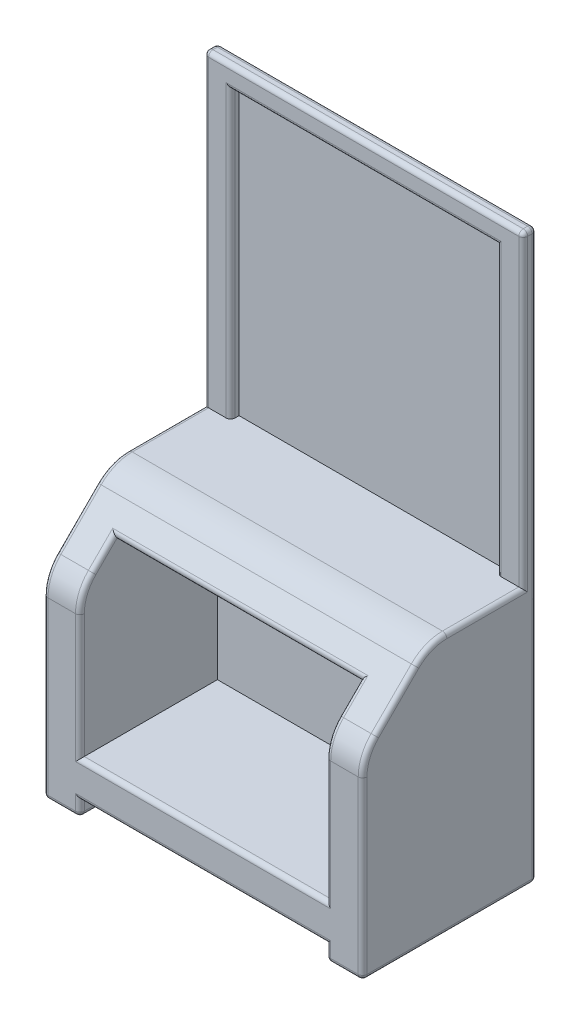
ISO-10303-21;
HEADER;
FILE_DESCRIPTION(('STEP AP214'),'2;1');
FILE_NAME('part.step','',(''),(''),'','','');
FILE_SCHEMA(('AUTOMOTIVE_DESIGN { 1 0 10303 214 1 1 1 1 }'));
ENDSEC;
DATA;
#1=APPLICATION_CONTEXT('core data for automotive mechanical design processes');
#2=APPLICATION_PROTOCOL_DEFINITION('international standard','automotive_design',2000,#1);
#3=PRODUCT_CONTEXT('',#1,'mechanical');
#4=PRODUCT('Part','Part','',(#3));
#5=PRODUCT_RELATED_PRODUCT_CATEGORY('part','',(#4));
#6=PRODUCT_DEFINITION_FORMATION('','',#4);
#7=PRODUCT_DEFINITION_CONTEXT('part definition',#1,'design');
#8=PRODUCT_DEFINITION('design','',#6,#7);
#9=PRODUCT_DEFINITION_SHAPE('','',#8);
#10=(LENGTH_UNIT() NAMED_UNIT(*) SI_UNIT(.MILLI.,.METRE.));
#11=(NAMED_UNIT(*) PLANE_ANGLE_UNIT() SI_UNIT($,.RADIAN.));
#12=(NAMED_UNIT(*) SI_UNIT($,.STERADIAN.) SOLID_ANGLE_UNIT());
#13=UNCERTAINTY_MEASURE_WITH_UNIT(LENGTH_MEASURE(1.E-05),#10,'distance_accuracy_value','');
#14=(GEOMETRIC_REPRESENTATION_CONTEXT(3) GLOBAL_UNCERTAINTY_ASSIGNED_CONTEXT((#13)) GLOBAL_UNIT_ASSIGNED_CONTEXT((#10,
#11,#12)) REPRESENTATION_CONTEXT('',''));
#15=CARTESIAN_POINT('',(0.,0.,0.));
#16=DIRECTION('',(0.,0.,1.));
#17=DIRECTION('',(1.,0.,0.));
#18=AXIS2_PLACEMENT_3D('',#15,#16,#17);
#19=CARTESIAN_POINT('',(36.25,56.,-16.7471340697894));
#20=DIRECTION('',(0.,0.,1.));
#21=DIRECTION('',(1.,0.,0.));
#22=AXIS2_PLACEMENT_3D('',#19,#20,#21);
#23=PLANE('',#22);
#24=DIRECTION('',(-1.,0.,0.));
#25=VECTOR('',#24,1.);
#26=CARTESIAN_POINT('',(30.2463185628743,125.,-16.7471340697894));
#27=LINE('',#26,#25);
#28=CARTESIAN_POINT('',(-31.2463185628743,125.,-16.7471340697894));
#29=VERTEX_POINT('',#28);
#30=CARTESIAN_POINT('',(31.2463185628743,125.,-16.7471340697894));
#31=VERTEX_POINT('',#30);
#32=EDGE_CURVE('E801',#29,#31,#27,.F.);
#33=ORIENTED_EDGE('',*,*,#32,.T.);
#34=DIRECTION('',(0.,-1.,0.));
#35=VECTOR('',#34,1.);
#36=CARTESIAN_POINT('',(31.2463185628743,56.,-16.7471340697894));
#37=LINE('',#36,#35);
#38=CARTESIAN_POINT('',(31.2463185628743,59.,-16.7471340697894));
#39=VERTEX_POINT('',#38);
#40=EDGE_CURVE('E803',#31,#39,#37,.T.);
#41=ORIENTED_EDGE('',*,*,#40,.T.);
#42=DIRECTION('',(1.,0.,0.));
#43=VECTOR('',#42,1.);
#44=CARTESIAN_POINT('',(0.,59.,-16.7471340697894));
#45=LINE('',#44,#43);
#46=CARTESIAN_POINT('',(35.25,59.,-16.7471340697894));
#47=VERTEX_POINT('',#46);
#48=EDGE_CURVE('E383',#39,#47,#45,.T.);
#49=ORIENTED_EDGE('',*,*,#48,.T.);
#50=DIRECTION('',(0.,1.,0.));
#51=VECTOR('',#50,1.);
#52=CARTESIAN_POINT('',(35.25,128.,-16.7471340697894));
#53=LINE('',#52,#51);
#54=CARTESIAN_POINT('',(35.25,128.,-16.7471340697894));
#55=VERTEX_POINT('',#54);
#56=EDGE_CURVE('E784',#47,#55,#53,.T.);
#57=ORIENTED_EDGE('',*,*,#56,.T.);
#58=DIRECTION('',(1.,0.,0.));
#59=VECTOR('',#58,1.);
#60=CARTESIAN_POINT('',(-35.25,128.,-16.7471340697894));
#61=LINE('',#60,#59);
#62=CARTESIAN_POINT('',(-35.25,128.,-16.7471340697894));
#63=VERTEX_POINT('',#62);
#64=EDGE_CURVE('E752',#55,#63,#61,.F.);
#65=ORIENTED_EDGE('',*,*,#64,.T.);
#66=DIRECTION('',(0.,1.,0.));
#67=VECTOR('',#66,1.);
#68=CARTESIAN_POINT('',(-35.25,58.,-16.7471340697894));
#69=LINE('',#68,#67);
#70=CARTESIAN_POINT('',(-35.25,59.,-16.7471340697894));
#71=VERTEX_POINT('',#70);
#72=EDGE_CURVE('E726',#63,#71,#69,.F.);
#73=ORIENTED_EDGE('',*,*,#72,.T.);
#74=CARTESIAN_POINT('',(-31.2463185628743,59.,-16.7471340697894));
#75=VERTEX_POINT('',#74);
#76=EDGE_CURVE('E386',#71,#75,#45,.T.);
#77=ORIENTED_EDGE('',*,*,#76,.T.);
#78=DIRECTION('',(0.,1.,0.));
#79=VECTOR('',#78,1.);
#80=CARTESIAN_POINT('',(-31.2463185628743,56.,-16.7471340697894));
#81=LINE('',#80,#79);
#82=EDGE_CURVE('E789',#75,#29,#81,.T.);
#83=ORIENTED_EDGE('',*,*,#82,.T.);
#84=EDGE_LOOP('',(#33,#41,#49,#57,#65,#73,#77,#83));
#85=FACE_BOUND('',#84,.T.);
#86=ADVANCED_FACE('F37',(#85),#23,.T.);
#87=CARTESIAN_POINT('',(-28.,11.75,-11.5));
#88=DIRECTION('',(-1.,0.,0.));
#89=DIRECTION('',(0.,-1.,0.));
#90=AXIS2_PLACEMENT_3D('',#87,#88,#89);
#91=PLANE('',#90);
#92=CARTESIAN_POINT('',(-28.,39.857864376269,9.75));
#93=DIRECTION('',(-1.,0.,0.));
#94=DIRECTION('',(0.,-1.,0.));
#95=AXIS2_PLACEMENT_3D('',#92,#93,#94);
#96=CIRCLE('',#95,9.);
#97=CARTESIAN_POINT('',(-28.,46.2218254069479,16.1139610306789));
#98=VERTEX_POINT('',#97);
#99=CARTESIAN_POINT('',(-28.,39.857864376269,18.75));
#100=VERTEX_POINT('',#99);
#101=EDGE_CURVE('E485',#98,#100,#96,.F.);
#102=ORIENTED_EDGE('',*,*,#101,.T.);
#103=DIRECTION('',(0.,-1.,0.));
#104=VECTOR('',#103,1.);
#105=CARTESIAN_POINT('',(-28.,11.75,18.75));
#106=LINE('',#105,#104);
#107=CARTESIAN_POINT('',(-28.,11.75,18.75));
#108=VERTEX_POINT('',#107);
#109=EDGE_CURVE('E487',#100,#108,#106,.T.);
#110=ORIENTED_EDGE('',*,*,#109,.T.);
#111=DIRECTION('',(0.,0.,1.));
#112=VECTOR('',#111,1.);
#113=CARTESIAN_POINT('',(-28.,11.75,-11.5));
#114=LINE('',#113,#112);
#115=CARTESIAN_POINT('',(-28.,11.75,-11.5));
#116=VERTEX_POINT('',#115);
#117=EDGE_CURVE('E409',#116,#108,#114,.T.);
#118=ORIENTED_EDGE('',*,*,#117,.F.);
#119=DIRECTION('',(0.,-1.,0.));
#120=VECTOR('',#119,1.);
#121=CARTESIAN_POINT('',(-28.,11.75,-11.5));
#122=LINE('',#121,#120);
#123=CARTESIAN_POINT('',(-28.,50.75,-11.5));
#124=VERTEX_POINT('',#123);
#125=EDGE_CURVE('E402',#124,#116,#122,.T.);
#126=ORIENTED_EDGE('',*,*,#125,.F.);
#127=DIRECTION('',(0.,0.,-1.));
#128=VECTOR('',#127,1.);
#129=CARTESIAN_POINT('',(-28.,50.75,-11.5));
#130=LINE('',#129,#128);
#131=CARTESIAN_POINT('',(-28.,50.75,10.5857864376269));
#132=VERTEX_POINT('',#131);
#133=EDGE_CURVE('E396',#132,#124,#130,.T.);
#134=ORIENTED_EDGE('',*,*,#133,.F.);
#135=CARTESIAN_POINT('',(-28.,51.75,10.5857864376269));
#136=DIRECTION('',(-1.,0.,0.));
#137=DIRECTION('',(0.,-1.,0.));
#138=AXIS2_PLACEMENT_3D('',#135,#136,#137);
#139=CIRCLE('',#138,1.);
#140=CARTESIAN_POINT('',(-28.,51.0428932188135,11.2928932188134));
#141=VERTEX_POINT('',#140);
#142=EDGE_CURVE('E576',#132,#141,#139,.T.);
#143=ORIENTED_EDGE('',*,*,#142,.T.);
#144=DIRECTION('',(0.,-0.707106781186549,0.707106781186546));
#145=VECTOR('',#144,1.);
#146=CARTESIAN_POINT('',(-28.,46.2218254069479,16.1139610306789));
#147=LINE('',#146,#145);
#148=EDGE_CURVE('E471',#141,#98,#147,.T.);
#149=ORIENTED_EDGE('',*,*,#148,.T.);
#150=EDGE_LOOP('',(#102,#110,#118,#126,#134,#143,#149));
#151=FACE_BOUND('',#150,.T.);
#152=ADVANCED_FACE('F978',(#151),#91,.F.);
#153=CARTESIAN_POINT('',(28.,11.75,-11.5));
#154=DIRECTION('',(1.,0.,0.));
#155=DIRECTION('',(0.,1.,0.));
#156=AXIS2_PLACEMENT_3D('',#153,#154,#155);
#157=PLANE('',#156);
#158=DIRECTION('',(0.,0.,1.));
#159=VECTOR('',#158,1.);
#160=CARTESIAN_POINT('',(28.,11.75,-11.5));
#161=LINE('',#160,#159);
#162=CARTESIAN_POINT('',(28.,11.75,-11.5));
#163=VERTEX_POINT('',#162);
#164=CARTESIAN_POINT('',(28.,11.75,18.75));
#165=VERTEX_POINT('',#164);
#166=EDGE_CURVE('E410',#163,#165,#161,.T.);
#167=ORIENTED_EDGE('',*,*,#166,.T.);
#168=DIRECTION('',(0.,1.,0.));
#169=VECTOR('',#168,1.);
#170=CARTESIAN_POINT('',(28.,11.75,18.75));
#171=LINE('',#170,#169);
#172=CARTESIAN_POINT('',(28.,39.857864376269,18.75));
#173=VERTEX_POINT('',#172);
#174=EDGE_CURVE('E512',#165,#173,#171,.T.);
#175=ORIENTED_EDGE('',*,*,#174,.T.);
#176=CARTESIAN_POINT('',(28.,39.857864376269,9.75));
#177=DIRECTION('',(1.,0.,0.));
#178=DIRECTION('',(0.,1.,0.));
#179=AXIS2_PLACEMENT_3D('',#176,#177,#178);
#180=CIRCLE('',#179,9.);
#181=CARTESIAN_POINT('',(28.,46.2218254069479,16.1139610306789));
#182=VERTEX_POINT('',#181);
#183=EDGE_CURVE('E510',#173,#182,#180,.F.);
#184=ORIENTED_EDGE('',*,*,#183,.T.);
#185=DIRECTION('',(0.,0.707106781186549,-0.707106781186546));
#186=VECTOR('',#185,1.);
#187=CARTESIAN_POINT('',(28.,50.0428932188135,12.2928932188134));
#188=LINE('',#187,#186);
#189=CARTESIAN_POINT('',(28.,51.0428932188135,11.2928932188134));
#190=VERTEX_POINT('',#189);
#191=EDGE_CURVE('E508',#182,#190,#188,.T.);
#192=ORIENTED_EDGE('',*,*,#191,.T.);
#193=CARTESIAN_POINT('',(28.,51.75,10.5857864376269));
#194=DIRECTION('',(1.,0.,0.));
#195=DIRECTION('',(0.,1.,0.));
#196=AXIS2_PLACEMENT_3D('',#193,#194,#195);
#197=CIRCLE('',#196,1.);
#198=CARTESIAN_POINT('',(28.,50.75,10.5857864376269));
#199=VERTEX_POINT('',#198);
#200=EDGE_CURVE('E585',#190,#199,#197,.T.);
#201=ORIENTED_EDGE('',*,*,#200,.T.);
#202=DIRECTION('',(0.,0.,1.));
#203=VECTOR('',#202,1.);
#204=CARTESIAN_POINT('',(28.,50.75,-11.5));
#205=LINE('',#204,#203);
#206=CARTESIAN_POINT('',(28.,50.75,-11.5));
#207=VERTEX_POINT('',#206);
#208=EDGE_CURVE('E398',#207,#199,#205,.T.);
#209=ORIENTED_EDGE('',*,*,#208,.F.);
#210=DIRECTION('',(0.,1.,0.));
#211=VECTOR('',#210,1.);
#212=CARTESIAN_POINT('',(28.,11.75,-11.5));
#213=LINE('',#212,#211);
#214=EDGE_CURVE('E407',#163,#207,#213,.T.);
#215=ORIENTED_EDGE('',*,*,#214,.F.);
#216=EDGE_LOOP('',(#167,#175,#184,#192,#201,#209,#215));
#217=FACE_BOUND('',#216,.T.);
#218=ADVANCED_FACE('F985',(#217),#157,.F.);
#219=CARTESIAN_POINT('',(0.,0.,-11.5));
#220=DIRECTION('',(0.,0.,-1.));
#221=DIRECTION('',(-1.,0.,0.));
#222=AXIS2_PLACEMENT_3D('',#219,#220,#221);
#223=PLANE('',#222);
#224=DIRECTION('',(1.,0.,0.));
#225=VECTOR('',#224,1.);
#226=CARTESIAN_POINT('',(0.,50.75,-11.5));
#227=LINE('',#226,#225);
#228=EDGE_CURVE('E418',#124,#207,#227,.T.);
#229=ORIENTED_EDGE('',*,*,#228,.F.);
#230=ORIENTED_EDGE('',*,*,#125,.T.);
#231=DIRECTION('',(1.,0.,0.));
#232=VECTOR('',#231,1.);
#233=CARTESIAN_POINT('',(-28.,11.75,-11.5));
#234=LINE('',#233,#232);
#235=EDGE_CURVE('E404',#116,#163,#234,.T.);
#236=ORIENTED_EDGE('',*,*,#235,.T.);
#237=ORIENTED_EDGE('',*,*,#214,.T.);
#238=EDGE_LOOP('',(#229,#230,#236,#237));
#239=FACE_BOUND('',#238,.T.);
#240=ADVANCED_FACE('F997',(#239),#223,.F.);
#241=CARTESIAN_POINT('',(0.,0.,0.));
#242=DIRECTION('',(0.,1.,0.));
#243=DIRECTION('',(0.,0.,1.));
#244=AXIS2_PLACEMENT_3D('',#241,#242,#243);
#245=PLANE('',#244);
#246=DIRECTION('',(0.,0.,1.));
#247=VECTOR('',#246,1.);
#248=CARTESIAN_POINT('',(-29.,0.,0.));
#249=LINE('',#248,#247);
#250=CARTESIAN_POINT('',(-29.,0.,-18.75));
#251=VERTEX_POINT('',#250);
#252=CARTESIAN_POINT('',(-29.,0.,18.75));
#253=VERTEX_POINT('',#252);
#254=EDGE_CURVE('E627',#251,#253,#249,.T.);
#255=ORIENTED_EDGE('',*,*,#254,.T.);
#256=DIRECTION('',(1.,0.,0.));
#257=VECTOR('',#256,1.);
#258=CARTESIAN_POINT('',(0.,0.,18.75));
#259=LINE('',#258,#257);
#260=CARTESIAN_POINT('',(-35.25,0.,18.75));
#261=VERTEX_POINT('',#260);
#262=EDGE_CURVE('E629',#253,#261,#259,.F.);
#263=ORIENTED_EDGE('',*,*,#262,.T.);
#264=DIRECTION('',(0.,0.,1.));
#265=VECTOR('',#264,1.);
#266=CARTESIAN_POINT('',(-35.25,0.,0.));
#267=LINE('',#266,#265);
#268=CARTESIAN_POINT('',(-35.25,0.,-18.75));
#269=VERTEX_POINT('',#268);
#270=EDGE_CURVE('E548',#261,#269,#267,.F.);
#271=ORIENTED_EDGE('',*,*,#270,.T.);
#272=DIRECTION('',(-1.,0.,0.));
#273=VECTOR('',#272,1.);
#274=CARTESIAN_POINT('',(0.,0.,-18.75));
#275=LINE('',#274,#273);
#276=EDGE_CURVE('E624',#269,#251,#275,.F.);
#277=ORIENTED_EDGE('',*,*,#276,.T.);
#278=EDGE_LOOP('',(#255,#263,#271,#277));
#279=FACE_BOUND('',#278,.T.);
#280=ADVANCED_FACE('F1000',(#279),#245,.F.);
#281=CARTESIAN_POINT('',(36.25,59.,-19.75));
#282=DIRECTION('',(-1.,0.,0.));
#283=DIRECTION('',(0.,0.,1.));
#284=AXIS2_PLACEMENT_3D('',#281,#282,#283);
#285=PLANE('',#284);
#286=DIRECTION('',(0.,-1.,0.));
#287=VECTOR('',#286,1.);
#288=CARTESIAN_POINT('',(36.25,59.,-18.75));
#289=LINE('',#288,#287);
#290=CARTESIAN_POINT('',(36.25,1.,-18.75));
#291=VERTEX_POINT('',#290);
#292=CARTESIAN_POINT('',(36.25,56.,-18.75));
#293=VERTEX_POINT('',#292);
#294=EDGE_CURVE('E453',#291,#293,#289,.F.);
#295=ORIENTED_EDGE('',*,*,#294,.T.);
#296=DIRECTION('',(0.,1.,0.));
#297=VECTOR('',#296,1.);
#298=CARTESIAN_POINT('',(36.25,59.,-18.75));
#299=LINE('',#298,#297);
#300=CARTESIAN_POINT('',(36.25,128.,-18.75));
#301=VERTEX_POINT('',#300);
#302=EDGE_CURVE('E773',#293,#301,#299,.T.);
#303=ORIENTED_EDGE('',*,*,#302,.T.);
#304=DIRECTION('',(0.,0.,-1.));
#305=VECTOR('',#304,1.);
#306=CARTESIAN_POINT('',(36.25,128.,-19.75));
#307=LINE('',#306,#305);
#308=CARTESIAN_POINT('',(36.25,128.,-17.7471340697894));
#309=VERTEX_POINT('',#308);
#310=EDGE_CURVE('E771',#301,#309,#307,.F.);
#311=ORIENTED_EDGE('',*,*,#310,.T.);
#312=DIRECTION('',(0.,1.,0.));
#313=VECTOR('',#312,1.);
#314=CARTESIAN_POINT('',(36.25,58.,-17.7471340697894));
#315=LINE('',#314,#313);
#316=CARTESIAN_POINT('',(36.25,58.,-17.7471340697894));
#317=VERTEX_POINT('',#316);
#318=EDGE_CURVE('E754',#309,#317,#315,.F.);
#319=ORIENTED_EDGE('',*,*,#318,.T.);
#320=DIRECTION('',(0.,0.,-1.));
#321=VECTOR('',#320,1.);
#322=CARTESIAN_POINT('',(36.25,58.,0.60786437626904));
#323=LINE('',#322,#321);
#324=CARTESIAN_POINT('',(36.25,58.,0.607864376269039));
#325=VERTEX_POINT('',#324);
#326=EDGE_CURVE('E439',#317,#325,#323,.F.);
#327=ORIENTED_EDGE('',*,*,#326,.T.);
#328=CARTESIAN_POINT('',(36.25,49.,0.607864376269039));
#329=DIRECTION('',(-1.,0.,0.));
#330=DIRECTION('',(0.,0.,1.));
#331=AXIS2_PLACEMENT_3D('',#328,#329,#330);
#332=CIRCLE('',#331,9.);
#333=CARTESIAN_POINT('',(36.25,55.3639610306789,6.97182540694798));
#334=VERTEX_POINT('',#333);
#335=EDGE_CURVE('E441',#325,#334,#332,.F.);
#336=ORIENTED_EDGE('',*,*,#335,.T.);
#337=DIRECTION('',(0.,-0.707106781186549,0.707106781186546));
#338=VECTOR('',#337,1.);
#339=CARTESIAN_POINT('',(36.25,46.2218254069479,16.1139610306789));
#340=LINE('',#339,#338);
#341=CARTESIAN_POINT('',(36.25,46.2218254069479,16.1139610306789));
#342=VERTEX_POINT('',#341);
#343=EDGE_CURVE('E443',#334,#342,#340,.T.);
#344=ORIENTED_EDGE('',*,*,#343,.T.);
#345=CARTESIAN_POINT('',(36.25,39.857864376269,9.75));
#346=DIRECTION('',(-1.,0.,0.));
#347=DIRECTION('',(0.,0.,1.));
#348=AXIS2_PLACEMENT_3D('',#345,#346,#347);
#349=CIRCLE('',#348,9.);
#350=CARTESIAN_POINT('',(36.25,39.857864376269,18.75));
#351=VERTEX_POINT('',#350);
#352=EDGE_CURVE('E445',#342,#351,#349,.F.);
#353=ORIENTED_EDGE('',*,*,#352,.T.);
#354=DIRECTION('',(0.,-1.,0.));
#355=VECTOR('',#354,1.);
#356=CARTESIAN_POINT('',(36.25,59.,18.75));
#357=LINE('',#356,#355);
#358=CARTESIAN_POINT('',(36.25,1.,18.75));
#359=VERTEX_POINT('',#358);
#360=EDGE_CURVE('E447',#351,#359,#357,.T.);
#361=ORIENTED_EDGE('',*,*,#360,.T.);
#362=DIRECTION('',(0.,0.,-1.));
#363=VECTOR('',#362,1.);
#364=CARTESIAN_POINT('',(36.25,1.,-19.75));
#365=LINE('',#364,#363);
#366=EDGE_CURVE('E450',#359,#291,#365,.T.);
#367=ORIENTED_EDGE('',*,*,#366,.T.);
#368=EDGE_LOOP('',(#295,#303,#311,#319,#327,#336,#344,#353,#361,#367));
#369=FACE_BOUND('',#368,.T.);
#370=ADVANCED_FACE('F936',(#369),#285,.F.);
#371=CARTESIAN_POINT('',(-36.25,59.,-19.75));
#372=DIRECTION('',(0.,0.,1.));
#373=DIRECTION('',(1.,0.,0.));
#374=AXIS2_PLACEMENT_3D('',#371,#372,#373);
#375=PLANE('',#374);
#376=DIRECTION('',(-1.,0.,0.));
#377=VECTOR('',#376,1.);
#378=CARTESIAN_POINT('',(-36.25,128.,-19.75));
#379=LINE('',#378,#377);
#380=CARTESIAN_POINT('',(-35.25,128.,-19.75));
#381=VERTEX_POINT('',#380);
#382=CARTESIAN_POINT('',(35.25,128.,-19.75));
#383=VERTEX_POINT('',#382);
#384=EDGE_CURVE('E743',#381,#383,#379,.F.);
#385=ORIENTED_EDGE('',*,*,#384,.T.);
#386=DIRECTION('',(0.,1.,0.));
#387=VECTOR('',#386,1.);
#388=CARTESIAN_POINT('',(35.25,59.,-19.75));
#389=LINE('',#388,#387);
#390=CARTESIAN_POINT('',(35.25,56.,-19.75));
#391=VERTEX_POINT('',#390);
#392=EDGE_CURVE('E776',#383,#391,#389,.F.);
#393=ORIENTED_EDGE('',*,*,#392,.T.);
#394=DIRECTION('',(0.,-1.,0.));
#395=VECTOR('',#394,1.);
#396=CARTESIAN_POINT('',(35.25,59.,-19.75));
#397=LINE('',#396,#395);
#398=CARTESIAN_POINT('',(35.25,1.,-19.75));
#399=VERTEX_POINT('',#398);
#400=EDGE_CURVE('E437',#391,#399,#397,.T.);
#401=ORIENTED_EDGE('',*,*,#400,.T.);
#402=DIRECTION('',(-1.,0.,0.));
#403=VECTOR('',#402,1.);
#404=CARTESIAN_POINT('',(-36.25,1.,-19.75));
#405=LINE('',#404,#403);
#406=CARTESIAN_POINT('',(29.,1.,-19.75));
#407=VERTEX_POINT('',#406);
#408=EDGE_CURVE('E688',#399,#407,#405,.T.);
#409=ORIENTED_EDGE('',*,*,#408,.T.);
#410=DIRECTION('',(0.,1.,0.));
#411=VECTOR('',#410,1.);
#412=CARTESIAN_POINT('',(29.,59.,-19.75));
#413=LINE('',#412,#411);
#414=CARTESIAN_POINT('',(29.,4.50000000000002,-19.75));
#415=VERTEX_POINT('',#414);
#416=EDGE_CURVE('E686',#407,#415,#413,.T.);
#417=ORIENTED_EDGE('',*,*,#416,.T.);
#418=DIRECTION('',(-1.,0.,0.));
#419=VECTOR('',#418,1.);
#420=CARTESIAN_POINT('',(-36.25,4.5,-19.75));
#421=LINE('',#420,#419);
#422=CARTESIAN_POINT('',(-29.,4.50000000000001,-19.75));
#423=VERTEX_POINT('',#422);
#424=EDGE_CURVE('E684',#415,#423,#421,.T.);
#425=ORIENTED_EDGE('',*,*,#424,.T.);
#426=DIRECTION('',(0.,-1.,0.));
#427=VECTOR('',#426,1.);
#428=CARTESIAN_POINT('',(-29.,59.,-19.75));
#429=LINE('',#428,#427);
#430=CARTESIAN_POINT('',(-29.,1.,-19.75));
#431=VERTEX_POINT('',#430);
#432=EDGE_CURVE('E712',#423,#431,#429,.T.);
#433=ORIENTED_EDGE('',*,*,#432,.T.);
#434=DIRECTION('',(-1.,0.,0.));
#435=VECTOR('',#434,1.);
#436=CARTESIAN_POINT('',(-36.25,1.,-19.75));
#437=LINE('',#436,#435);
#438=CARTESIAN_POINT('',(-35.25,1.,-19.75));
#439=VERTEX_POINT('',#438);
#440=EDGE_CURVE('E639',#431,#439,#437,.T.);
#441=ORIENTED_EDGE('',*,*,#440,.T.);
#442=DIRECTION('',(0.,-1.,0.));
#443=VECTOR('',#442,1.);
#444=CARTESIAN_POINT('',(-35.25,59.,-19.75));
#445=LINE('',#444,#443);
#446=CARTESIAN_POINT('',(-35.25,56.,-19.75));
#447=VERTEX_POINT('',#446);
#448=EDGE_CURVE('E551',#439,#447,#445,.F.);
#449=ORIENTED_EDGE('',*,*,#448,.T.);
#450=DIRECTION('',(0.,1.,0.));
#451=VECTOR('',#450,1.);
#452=CARTESIAN_POINT('',(-35.25,59.,-19.75));
#453=LINE('',#452,#451);
#454=EDGE_CURVE('E731',#447,#381,#453,.T.);
#455=ORIENTED_EDGE('',*,*,#454,.T.);
#456=EDGE_LOOP('',(#385,#393,#401,#409,#417,#425,#433,#441,#449,#455));
#457=FACE_BOUND('',#456,.T.);
#458=ADVANCED_FACE('F860',(#457),#375,.F.);
#459=CARTESIAN_POINT('',(-36.25,59.,-19.75));
#460=DIRECTION('',(1.,0.,0.));
#461=DIRECTION('',(0.,0.,-1.));
#462=AXIS2_PLACEMENT_3D('',#459,#460,#461);
#463=PLANE('',#462);
#464=DIRECTION('',(0.,1.,0.));
#465=VECTOR('',#464,1.);
#466=CARTESIAN_POINT('',(-36.25,129.,-17.7471340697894));
#467=LINE('',#466,#465);
#468=CARTESIAN_POINT('',(-36.25,58.,-17.7471340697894));
#469=VERTEX_POINT('',#468);
#470=CARTESIAN_POINT('',(-36.25,128.,-17.7471340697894));
#471=VERTEX_POINT('',#470);
#472=EDGE_CURVE('E723',#469,#471,#467,.T.);
#473=ORIENTED_EDGE('',*,*,#472,.T.);
#474=DIRECTION('',(0.,0.,1.));
#475=VECTOR('',#474,1.);
#476=CARTESIAN_POINT('',(-36.25,128.,-19.75));
#477=LINE('',#476,#475);
#478=CARTESIAN_POINT('',(-36.25,128.,-18.75));
#479=VERTEX_POINT('',#478);
#480=EDGE_CURVE('E748',#471,#479,#477,.F.);
#481=ORIENTED_EDGE('',*,*,#480,.T.);
#482=DIRECTION('',(0.,1.,0.));
#483=VECTOR('',#482,1.);
#484=CARTESIAN_POINT('',(-36.25,59.,-18.75));
#485=LINE('',#484,#483);
#486=CARTESIAN_POINT('',(-36.25,56.,-18.75));
#487=VERTEX_POINT('',#486);
#488=EDGE_CURVE('E734',#479,#487,#485,.F.);
#489=ORIENTED_EDGE('',*,*,#488,.T.);
#490=DIRECTION('',(0.,-1.,0.));
#491=VECTOR('',#490,1.);
#492=CARTESIAN_POINT('',(-36.25,59.,-18.75));
#493=LINE('',#492,#491);
#494=CARTESIAN_POINT('',(-36.25,1.,-18.75));
#495=VERTEX_POINT('',#494);
#496=EDGE_CURVE('E532',#487,#495,#493,.T.);
#497=ORIENTED_EDGE('',*,*,#496,.T.);
#498=DIRECTION('',(0.,0.,1.));
#499=VECTOR('',#498,1.);
#500=CARTESIAN_POINT('',(-36.25,1.,-19.75));
#501=LINE('',#500,#499);
#502=CARTESIAN_POINT('',(-36.25,1.,18.75));
#503=VERTEX_POINT('',#502);
#504=EDGE_CURVE('E534',#495,#503,#501,.T.);
#505=ORIENTED_EDGE('',*,*,#504,.T.);
#506=DIRECTION('',(0.,-1.,0.));
#507=VECTOR('',#506,1.);
#508=CARTESIAN_POINT('',(-36.25,59.,18.75));
#509=LINE('',#508,#507);
#510=CARTESIAN_POINT('',(-36.25,39.857864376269,18.75));
#511=VERTEX_POINT('',#510);
#512=EDGE_CURVE('E537',#503,#511,#509,.F.);
#513=ORIENTED_EDGE('',*,*,#512,.T.);
#514=CARTESIAN_POINT('',(-36.25,39.857864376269,9.75));
#515=DIRECTION('',(1.,0.,0.));
#516=DIRECTION('',(0.,0.,-1.));
#517=AXIS2_PLACEMENT_3D('',#514,#515,#516);
#518=CIRCLE('',#517,9.);
#519=CARTESIAN_POINT('',(-36.25,46.2218254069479,16.1139610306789));
#520=VERTEX_POINT('',#519);
#521=EDGE_CURVE('E539',#511,#520,#518,.F.);
#522=ORIENTED_EDGE('',*,*,#521,.T.);
#523=DIRECTION('',(0.,0.707106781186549,-0.707106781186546));
#524=VECTOR('',#523,1.);
#525=CARTESIAN_POINT('',(-36.25,55.3639610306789,6.97182540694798));
#526=LINE('',#525,#524);
#527=CARTESIAN_POINT('',(-36.25,55.3639610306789,6.97182540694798));
#528=VERTEX_POINT('',#527);
#529=EDGE_CURVE('E521',#520,#528,#526,.T.);
#530=ORIENTED_EDGE('',*,*,#529,.T.);
#531=CARTESIAN_POINT('',(-36.25,49.,0.607864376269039));
#532=DIRECTION('',(1.,0.,0.));
#533=DIRECTION('',(0.,0.,-1.));
#534=AXIS2_PLACEMENT_3D('',#531,#532,#533);
#535=CIRCLE('',#534,9.);
#536=CARTESIAN_POINT('',(-36.25,58.,0.607864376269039));
#537=VERTEX_POINT('',#536);
#538=EDGE_CURVE('E528',#528,#537,#535,.F.);
#539=ORIENTED_EDGE('',*,*,#538,.T.);
#540=DIRECTION('',(0.,0.,1.));
#541=VECTOR('',#540,1.);
#542=CARTESIAN_POINT('',(-36.25,58.,-19.75));
#543=LINE('',#542,#541);
#544=EDGE_CURVE('E530',#537,#469,#543,.F.);
#545=ORIENTED_EDGE('',*,*,#544,.T.);
#546=EDGE_LOOP('',(#473,#481,#489,#497,#505,#513,#522,#530,#539,#545));
#547=FACE_BOUND('',#546,.T.);
#548=ADVANCED_FACE('F850',(#547),#463,.F.);
#549=CARTESIAN_POINT('',(-36.25,59.,19.75));
#550=DIRECTION('',(0.,0.,-1.));
#551=DIRECTION('',(-1.,0.,0.));
#552=AXIS2_PLACEMENT_3D('',#549,#550,#551);
#553=PLANE('',#552);
#554=DIRECTION('',(0.,1.,0.));
#555=VECTOR('',#554,1.);
#556=CARTESIAN_POINT('',(29.,59.,19.75));
#557=LINE('',#556,#555);
#558=CARTESIAN_POINT('',(29.,4.50000000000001,19.75));
#559=VERTEX_POINT('',#558);
#560=CARTESIAN_POINT('',(29.,1.,19.75));
#561=VERTEX_POINT('',#560);
#562=EDGE_CURVE('E603',#559,#561,#557,.F.);
#563=ORIENTED_EDGE('',*,*,#562,.T.);
#564=DIRECTION('',(1.,0.,0.));
#565=VECTOR('',#564,1.);
#566=CARTESIAN_POINT('',(-36.25,1.,19.75));
#567=LINE('',#566,#565);
#568=CARTESIAN_POINT('',(35.25,1.,19.75));
#569=VERTEX_POINT('',#568);
#570=EDGE_CURVE('E666',#561,#569,#567,.T.);
#571=ORIENTED_EDGE('',*,*,#570,.T.);
#572=DIRECTION('',(0.,-1.,0.));
#573=VECTOR('',#572,1.);
#574=CARTESIAN_POINT('',(35.25,59.,19.75));
#575=LINE('',#574,#573);
#576=CARTESIAN_POINT('',(35.25,39.857864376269,19.75));
#577=VERTEX_POINT('',#576);
#578=EDGE_CURVE('E458',#569,#577,#575,.F.);
#579=ORIENTED_EDGE('',*,*,#578,.T.);
#580=DIRECTION('',(-1.,0.,0.));
#581=VECTOR('',#580,1.);
#582=CARTESIAN_POINT('',(28.,39.857864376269,19.75));
#583=LINE('',#582,#581);
#584=CARTESIAN_POINT('',(29.,39.857864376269,19.75));
#585=VERTEX_POINT('',#584);
#586=EDGE_CURVE('E425',#577,#585,#583,.T.);
#587=ORIENTED_EDGE('',*,*,#586,.T.);
#588=DIRECTION('',(0.,1.,0.));
#589=VECTOR('',#588,1.);
#590=CARTESIAN_POINT('',(29.,59.,19.75));
#591=LINE('',#590,#589);
#592=CARTESIAN_POINT('',(29.,10.75,19.75));
#593=VERTEX_POINT('',#592);
#594=EDGE_CURVE('E515',#585,#593,#591,.F.);
#595=ORIENTED_EDGE('',*,*,#594,.T.);
#596=DIRECTION('',(1.,0.,0.));
#597=VECTOR('',#596,1.);
#598=CARTESIAN_POINT('',(-36.25,10.75,19.75));
#599=LINE('',#598,#597);
#600=CARTESIAN_POINT('',(-29.,10.75,19.75));
#601=VERTEX_POINT('',#600);
#602=EDGE_CURVE('E590',#593,#601,#599,.F.);
#603=ORIENTED_EDGE('',*,*,#602,.T.);
#604=DIRECTION('',(0.,-1.,0.));
#605=VECTOR('',#604,1.);
#606=CARTESIAN_POINT('',(-29.,59.,19.75));
#607=LINE('',#606,#605);
#608=CARTESIAN_POINT('',(-29.,39.857864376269,19.75));
#609=VERTEX_POINT('',#608);
#610=EDGE_CURVE('E490',#601,#609,#607,.F.);
#611=ORIENTED_EDGE('',*,*,#610,.T.);
#612=DIRECTION('',(-1.,0.,0.));
#613=VECTOR('',#612,1.);
#614=CARTESIAN_POINT('',(-36.25,39.857864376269,19.75));
#615=LINE('',#614,#613);
#616=CARTESIAN_POINT('',(-35.25,39.857864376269,19.75));
#617=VERTEX_POINT('',#616);
#618=EDGE_CURVE('E422',#609,#617,#615,.T.);
#619=ORIENTED_EDGE('',*,*,#618,.T.);
#620=DIRECTION('',(0.,-1.,0.));
#621=VECTOR('',#620,1.);
#622=CARTESIAN_POINT('',(-35.25,59.,19.75));
#623=LINE('',#622,#621);
#624=CARTESIAN_POINT('',(-35.25,1.,19.75));
#625=VERTEX_POINT('',#624);
#626=EDGE_CURVE('E545',#617,#625,#623,.T.);
#627=ORIENTED_EDGE('',*,*,#626,.T.);
#628=DIRECTION('',(1.,0.,0.));
#629=VECTOR('',#628,1.);
#630=CARTESIAN_POINT('',(-36.25,1.,19.75));
#631=LINE('',#630,#629);
#632=CARTESIAN_POINT('',(-29.,1.,19.75));
#633=VERTEX_POINT('',#632);
#634=EDGE_CURVE('E622',#625,#633,#631,.T.);
#635=ORIENTED_EDGE('',*,*,#634,.T.);
#636=DIRECTION('',(0.,-1.,0.));
#637=VECTOR('',#636,1.);
#638=CARTESIAN_POINT('',(-29.,59.,19.75));
#639=LINE('',#638,#637);
#640=CARTESIAN_POINT('',(-29.,4.5,19.75));
#641=VERTEX_POINT('',#640);
#642=EDGE_CURVE('E506',#633,#641,#639,.F.);
#643=ORIENTED_EDGE('',*,*,#642,.T.);
#644=DIRECTION('',(-1.,0.,0.));
#645=VECTOR('',#644,1.);
#646=CARTESIAN_POINT('',(-36.25,4.5,19.75));
#647=LINE('',#646,#645);
#648=EDGE_CURVE('E601',#641,#559,#647,.F.);
#649=ORIENTED_EDGE('',*,*,#648,.T.);
#650=EDGE_LOOP('',(#563,#571,#579,#587,#595,#603,#611,#619,#627,#635,#643,#649));
#651=FACE_BOUND('',#650,.T.);
#652=ADVANCED_FACE('F898',(#651),#553,.F.);
#653=CARTESIAN_POINT('',(0.,59.,0.));
#654=DIRECTION('',(0.,1.,0.));
#655=DIRECTION('',(0.,0.,1.));
#656=AXIS2_PLACEMENT_3D('',#653,#654,#655);
#657=PLANE('',#656);
#658=DIRECTION('',(0.,0.,1.));
#659=VECTOR('',#658,1.);
#660=CARTESIAN_POINT('',(-30.2463185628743,59.,-18.6715653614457));
#661=LINE('',#660,#659);
#662=CARTESIAN_POINT('',(-30.2463185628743,59.,-18.6715653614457));
#663=VERTEX_POINT('',#662);
#664=CARTESIAN_POINT('',(-30.2463185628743,59.,-17.7471340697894));
#665=VERTEX_POINT('',#664);
#666=EDGE_CURVE('E372',#663,#665,#661,.T.);
#667=ORIENTED_EDGE('',*,*,#666,.T.);
#668=CARTESIAN_POINT('',(-31.2463185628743,59.,-17.7471340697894));
#669=DIRECTION('',(0.,1.,0.));
#670=DIRECTION('',(0.,0.,1.));
#671=AXIS2_PLACEMENT_3D('',#668,#669,#670);
#672=CIRCLE('',#671,1.);
#673=EDGE_CURVE('E11',#665,#75,#672,.F.);
#674=ORIENTED_EDGE('',*,*,#673,.T.);
#675=ORIENTED_EDGE('',*,*,#76,.F.);
#676=DIRECTION('',(0.,0.,1.));
#677=VECTOR('',#676,1.);
#678=CARTESIAN_POINT('',(-35.25,59.,0.60786437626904));
#679=LINE('',#678,#677);
#680=CARTESIAN_POINT('',(-35.25,59.,0.607864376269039));
#681=VERTEX_POINT('',#680);
#682=EDGE_CURVE('E554',#71,#681,#679,.T.);
#683=ORIENTED_EDGE('',*,*,#682,.T.);
#684=DIRECTION('',(1.,0.,0.));
#685=VECTOR('',#684,1.);
#686=CARTESIAN_POINT('',(0.,59.,0.607864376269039));
#687=LINE('',#686,#685);
#688=CARTESIAN_POINT('',(35.25,59.,0.607864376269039));
#689=VERTEX_POINT('',#688);
#690=EDGE_CURVE('E432',#681,#689,#687,.T.);
#691=ORIENTED_EDGE('',*,*,#690,.T.);
#692=DIRECTION('',(0.,0.,-1.));
#693=VECTOR('',#692,1.);
#694=CARTESIAN_POINT('',(35.25,59.,-19.75));
#695=LINE('',#694,#693);
#696=EDGE_CURVE('E468',#689,#47,#695,.T.);
#697=ORIENTED_EDGE('',*,*,#696,.T.);
#698=ORIENTED_EDGE('',*,*,#48,.F.);
#699=CARTESIAN_POINT('',(31.2463185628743,59.,-17.7471340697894));
#700=DIRECTION('',(0.,1.,0.));
#701=DIRECTION('',(0.,0.,1.));
#702=AXIS2_PLACEMENT_3D('',#699,#700,#701);
#703=CIRCLE('',#702,1.);
#704=CARTESIAN_POINT('',(30.2463185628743,59.,-17.7471340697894));
#705=VERTEX_POINT('',#704);
#706=EDGE_CURVE('E46',#39,#705,#703,.F.);
#707=ORIENTED_EDGE('',*,*,#706,.T.);
#708=DIRECTION('',(0.,0.,-1.));
#709=VECTOR('',#708,1.);
#710=CARTESIAN_POINT('',(30.2463185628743,59.,-18.6715653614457));
#711=LINE('',#710,#709);
#712=CARTESIAN_POINT('',(30.2463185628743,59.,-18.6715653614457));
#713=VERTEX_POINT('',#712);
#714=EDGE_CURVE('E768',#705,#713,#711,.T.);
#715=ORIENTED_EDGE('',*,*,#714,.T.);
#716=DIRECTION('',(-1.,0.,0.));
#717=VECTOR('',#716,1.);
#718=CARTESIAN_POINT('',(-30.2463185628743,59.,-18.6715653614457));
#719=LINE('',#718,#717);
#720=EDGE_CURVE('E382',#713,#663,#719,.T.);
#721=ORIENTED_EDGE('',*,*,#720,.T.);
#722=EDGE_LOOP('',(#667,#674,#675,#683,#691,#697,#698,#707,#715,#721));
#723=FACE_BOUND('',#722,.T.);
#724=ADVANCED_FACE('F824',(#723),#657,.T.);
#725=DIRECTION('',(0.,0.,-1.));
#726=VECTOR('',#725,1.);
#727=CARTESIAN_POINT('',(29.,0.,0.));
#728=LINE('',#727,#726);
#729=CARTESIAN_POINT('',(29.,0.,18.75));
#730=VERTEX_POINT('',#729);
#731=CARTESIAN_POINT('',(29.,0.,-18.75));
#732=VERTEX_POINT('',#731);
#733=EDGE_CURVE('E654',#730,#732,#728,.T.);
#734=ORIENTED_EDGE('',*,*,#733,.T.);
#735=DIRECTION('',(-1.,0.,0.));
#736=VECTOR('',#735,1.);
#737=CARTESIAN_POINT('',(0.,0.,-18.75));
#738=LINE('',#737,#736);
#739=CARTESIAN_POINT('',(35.25,0.,-18.75));
#740=VERTEX_POINT('',#739);
#741=EDGE_CURVE('E690',#732,#740,#738,.F.);
#742=ORIENTED_EDGE('',*,*,#741,.T.);
#743=DIRECTION('',(0.,0.,-1.));
#744=VECTOR('',#743,1.);
#745=CARTESIAN_POINT('',(35.25,0.,0.));
#746=LINE('',#745,#744);
#747=CARTESIAN_POINT('',(35.25,0.,18.75));
#748=VERTEX_POINT('',#747);
#749=EDGE_CURVE('E456',#740,#748,#746,.F.);
#750=ORIENTED_EDGE('',*,*,#749,.T.);
#751=DIRECTION('',(1.,0.,0.));
#752=VECTOR('',#751,1.);
#753=CARTESIAN_POINT('',(0.,0.,18.75));
#754=LINE('',#753,#752);
#755=EDGE_CURVE('E641',#748,#730,#754,.F.);
#756=ORIENTED_EDGE('',*,*,#755,.T.);
#757=EDGE_LOOP('',(#734,#742,#750,#756));
#758=FACE_BOUND('',#757,.T.);
#759=ADVANCED_FACE('F916',(#758),#245,.F.);
#760=CARTESIAN_POINT('',(-28.,3.5,-39.25));
#761=DIRECTION('',(0.,1.,0.));
#762=DIRECTION('',(-1.,0.,0.));
#763=AXIS2_PLACEMENT_3D('',#760,#761,#762);
#764=PLANE('',#763);
#765=DIRECTION('',(0.,0.,1.));
#766=VECTOR('',#765,1.);
#767=CARTESIAN_POINT('',(-28.,3.5,-39.25));
#768=LINE('',#767,#766);
#769=CARTESIAN_POINT('',(-28.,3.5,-18.75));
#770=VERTEX_POINT('',#769);
#771=CARTESIAN_POINT('',(-28.,3.5,18.75));
#772=VERTEX_POINT('',#771);
#773=EDGE_CURVE('E416',#770,#772,#768,.T.);
#774=ORIENTED_EDGE('',*,*,#773,.F.);
#775=DIRECTION('',(-1.,0.,0.));
#776=VECTOR('',#775,1.);
#777=CARTESIAN_POINT('',(-28.,3.5,-18.75));
#778=LINE('',#777,#776);
#779=CARTESIAN_POINT('',(28.,3.50000000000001,-18.75));
#780=VERTEX_POINT('',#779);
#781=EDGE_CURVE('E694',#770,#780,#778,.F.);
#782=ORIENTED_EDGE('',*,*,#781,.T.);
#783=DIRECTION('',(0.,0.,1.));
#784=VECTOR('',#783,1.);
#785=CARTESIAN_POINT('',(28.,3.50000000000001,-39.25));
#786=LINE('',#785,#784);
#787=CARTESIAN_POINT('',(28.,3.50000000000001,18.75));
#788=VERTEX_POINT('',#787);
#789=EDGE_CURVE('E413',#780,#788,#786,.T.);
#790=ORIENTED_EDGE('',*,*,#789,.T.);
#791=DIRECTION('',(-1.,0.,0.));
#792=VECTOR('',#791,1.);
#793=CARTESIAN_POINT('',(-28.,3.5,18.75));
#794=LINE('',#793,#792);
#795=EDGE_CURVE('E606',#788,#772,#794,.T.);
#796=ORIENTED_EDGE('',*,*,#795,.T.);
#797=EDGE_LOOP('',(#774,#782,#790,#796));
#798=FACE_BOUND('',#797,.T.);
#799=ADVANCED_FACE('F1009',(#798),#764,.F.);
#800=CARTESIAN_POINT('',(-28.,0.,-39.25));
#801=DIRECTION('',(-1.,0.,0.));
#802=DIRECTION('',(0.,0.,1.));
#803=AXIS2_PLACEMENT_3D('',#800,#801,#802);
#804=PLANE('',#803);
#805=DIRECTION('',(0.,0.,1.));
#806=VECTOR('',#805,1.);
#807=CARTESIAN_POINT('',(-28.,1.,-39.25));
#808=LINE('',#807,#806);
#809=CARTESIAN_POINT('',(-28.,1.,18.75));
#810=VERTEX_POINT('',#809);
#811=CARTESIAN_POINT('',(-28.,1.,-18.75));
#812=VERTEX_POINT('',#811);
#813=EDGE_CURVE('E636',#810,#812,#808,.F.);
#814=ORIENTED_EDGE('',*,*,#813,.T.);
#815=DIRECTION('',(0.,-1.,0.));
#816=VECTOR('',#815,1.);
#817=CARTESIAN_POINT('',(-28.,0.,-18.75));
#818=LINE('',#817,#816);
#819=EDGE_CURVE('E714',#812,#770,#818,.F.);
#820=ORIENTED_EDGE('',*,*,#819,.T.);
#821=ORIENTED_EDGE('',*,*,#773,.T.);
#822=DIRECTION('',(0.,-1.,0.));
#823=VECTOR('',#822,1.);
#824=CARTESIAN_POINT('',(-28.,0.,18.75));
#825=LINE('',#824,#823);
#826=EDGE_CURVE('E497',#772,#810,#825,.T.);
#827=ORIENTED_EDGE('',*,*,#826,.T.);
#828=EDGE_LOOP('',(#814,#820,#821,#827));
#829=FACE_BOUND('',#828,.T.);
#830=ADVANCED_FACE('F884',(#829),#804,.F.);
#831=CARTESIAN_POINT('',(28.,0.,-39.25));
#832=DIRECTION('',(1.,0.,0.));
#833=DIRECTION('',(0.,0.,-1.));
#834=AXIS2_PLACEMENT_3D('',#831,#832,#833);
#835=PLANE('',#834);
#836=ORIENTED_EDGE('',*,*,#789,.F.);
#837=DIRECTION('',(0.,1.,0.));
#838=VECTOR('',#837,1.);
#839=CARTESIAN_POINT('',(28.,0.,-18.75));
#840=LINE('',#839,#838);
#841=CARTESIAN_POINT('',(28.,1.,-18.75));
#842=VERTEX_POINT('',#841);
#843=EDGE_CURVE('E692',#780,#842,#840,.F.);
#844=ORIENTED_EDGE('',*,*,#843,.T.);
#845=DIRECTION('',(0.,0.,-1.));
#846=VECTOR('',#845,1.);
#847=CARTESIAN_POINT('',(28.,1.,-39.25));
#848=LINE('',#847,#846);
#849=CARTESIAN_POINT('',(28.,1.,18.75));
#850=VERTEX_POINT('',#849);
#851=EDGE_CURVE('E657',#842,#850,#848,.F.);
#852=ORIENTED_EDGE('',*,*,#851,.T.);
#853=DIRECTION('',(0.,1.,0.));
#854=VECTOR('',#853,1.);
#855=CARTESIAN_POINT('',(28.,0.,18.75));
#856=LINE('',#855,#854);
#857=EDGE_CURVE('E598',#850,#788,#856,.T.);
#858=ORIENTED_EDGE('',*,*,#857,.T.);
#859=EDGE_LOOP('',(#836,#844,#852,#858));
#860=FACE_BOUND('',#859,.T.);
#861=ADVANCED_FACE('F1013',(#860),#835,.F.);
#862=CARTESIAN_POINT('',(0.,59.,4.75));
#863=DIRECTION('',(0.,0.707106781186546,0.707106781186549));
#864=DIRECTION('',(-1.,0.,0.));
#865=AXIS2_PLACEMENT_3D('',#862,#863,#864);
#866=PLANE('',#865);
#867=DIRECTION('',(0.,-0.707106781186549,0.707106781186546));
#868=VECTOR('',#867,1.);
#869=CARTESIAN_POINT('',(-29.,50.75,13.));
#870=LINE('',#869,#868);
#871=CARTESIAN_POINT('',(-29.,46.9289321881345,16.8210678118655));
#872=VERTEX_POINT('',#871);
#873=CARTESIAN_POINT('',(-29.,52.4571067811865,11.2928932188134));
#874=VERTEX_POINT('',#873);
#875=EDGE_CURVE('E495',#872,#874,#870,.F.);
#876=ORIENTED_EDGE('',*,*,#875,.T.);
#877=DIRECTION('',(-1.,0.,0.));
#878=VECTOR('',#877,1.);
#879=CARTESIAN_POINT('',(29.,52.4571067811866,11.2928932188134));
#880=LINE('',#879,#878);
#881=CARTESIAN_POINT('',(29.,52.4571067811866,11.2928932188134));
#882=VERTEX_POINT('',#881);
#883=EDGE_CURVE('E573',#874,#882,#880,.F.);
#884=ORIENTED_EDGE('',*,*,#883,.T.);
#885=DIRECTION('',(0.,0.707106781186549,-0.707106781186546));
#886=VECTOR('',#885,1.);
#887=CARTESIAN_POINT('',(29.,46.9289321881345,16.8210678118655));
#888=LINE('',#887,#886);
#889=CARTESIAN_POINT('',(29.,46.9289321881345,16.8210678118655));
#890=VERTEX_POINT('',#889);
#891=EDGE_CURVE('E519',#882,#890,#888,.F.);
#892=ORIENTED_EDGE('',*,*,#891,.T.);
#893=DIRECTION('',(-1.,0.,0.));
#894=VECTOR('',#893,1.);
#895=CARTESIAN_POINT('',(36.25,46.9289321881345,16.8210678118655));
#896=LINE('',#895,#894);
#897=CARTESIAN_POINT('',(35.25,46.9289321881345,16.8210678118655));
#898=VERTEX_POINT('',#897);
#899=EDGE_CURVE('E430',#890,#898,#896,.F.);
#900=ORIENTED_EDGE('',*,*,#899,.T.);
#901=DIRECTION('',(0.,-0.707106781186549,0.707106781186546));
#902=VECTOR('',#901,1.);
#903=CARTESIAN_POINT('',(35.25,56.0710678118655,7.67893218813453));
#904=LINE('',#903,#902);
#905=CARTESIAN_POINT('',(35.25,56.0710678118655,7.67893218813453));
#906=VERTEX_POINT('',#905);
#907=EDGE_CURVE('E463',#898,#906,#904,.F.);
#908=ORIENTED_EDGE('',*,*,#907,.T.);
#909=DIRECTION('',(1.,0.,0.));
#910=VECTOR('',#909,1.);
#911=CARTESIAN_POINT('',(0.,56.0710678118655,7.67893218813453));
#912=LINE('',#911,#910);
#913=CARTESIAN_POINT('',(-35.25,56.0710678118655,7.67893218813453));
#914=VERTEX_POINT('',#913);
#915=EDGE_CURVE('E434',#906,#914,#912,.F.);
#916=ORIENTED_EDGE('',*,*,#915,.T.);
#917=DIRECTION('',(0.,0.707106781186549,-0.707106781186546));
#918=VECTOR('',#917,1.);
#919=CARTESIAN_POINT('',(-35.25,46.9289321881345,16.8210678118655));
#920=LINE('',#919,#918);
#921=CARTESIAN_POINT('',(-35.25,46.9289321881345,16.8210678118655));
#922=VERTEX_POINT('',#921);
#923=EDGE_CURVE('E558',#914,#922,#920,.F.);
#924=ORIENTED_EDGE('',*,*,#923,.T.);
#925=DIRECTION('',(-1.,0.,0.));
#926=VECTOR('',#925,1.);
#927=CARTESIAN_POINT('',(-28.,46.9289321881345,16.8210678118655));
#928=LINE('',#927,#926);
#929=EDGE_CURVE('E428',#922,#872,#928,.F.);
#930=ORIENTED_EDGE('',*,*,#929,.T.);
#931=EDGE_LOOP('',(#876,#884,#892,#900,#908,#916,#924,#930));
#932=FACE_BOUND('',#931,.T.);
#933=ADVANCED_FACE('F1006',(#932),#866,.T.);
#934=CARTESIAN_POINT('',(-28.,11.75,-11.5));
#935=DIRECTION('',(0.,-1.,0.));
#936=DIRECTION('',(1.,0.,0.));
#937=AXIS2_PLACEMENT_3D('',#934,#935,#936);
#938=PLANE('',#937);
#939=ORIENTED_EDGE('',*,*,#117,.T.);
#940=DIRECTION('',(1.,0.,0.));
#941=VECTOR('',#940,1.);
#942=CARTESIAN_POINT('',(-28.,11.75,18.75));
#943=LINE('',#942,#941);
#944=EDGE_CURVE('E587',#108,#165,#943,.T.);
#945=ORIENTED_EDGE('',*,*,#944,.T.);
#946=ORIENTED_EDGE('',*,*,#166,.F.);
#947=ORIENTED_EDGE('',*,*,#235,.F.);
#948=EDGE_LOOP('',(#939,#945,#946,#947));
#949=FACE_BOUND('',#948,.T.);
#950=ADVANCED_FACE('F995',(#949),#938,.F.);
#951=CARTESIAN_POINT('',(31.,50.75,-11.5));
#952=DIRECTION('',(0.,1.,0.));
#953=DIRECTION('',(-1.,0.,0.));
#954=AXIS2_PLACEMENT_3D('',#951,#952,#953);
#955=PLANE('',#954);
#956=ORIENTED_EDGE('',*,*,#208,.T.);
#957=DIRECTION('',(-1.,0.,0.));
#958=VECTOR('',#957,1.);
#959=CARTESIAN_POINT('',(-29.,50.75,10.5857864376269));
#960=LINE('',#959,#958);
#961=EDGE_CURVE('E560',#199,#132,#960,.T.);
#962=ORIENTED_EDGE('',*,*,#961,.T.);
#963=ORIENTED_EDGE('',*,*,#133,.T.);
#964=ORIENTED_EDGE('',*,*,#228,.T.);
#965=EDGE_LOOP('',(#956,#962,#963,#964));
#966=FACE_BOUND('',#965,.T.);
#967=ADVANCED_FACE('F991',(#966),#955,.F.);
#968=CARTESIAN_POINT('',(-36.25,39.857864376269,9.75));
#969=DIRECTION('',(1.,0.,0.));
#970=DIRECTION('',(0.,0.,-1.));
#971=AXIS2_PLACEMENT_3D('',#968,#969,#970);
#972=CYLINDRICAL_SURFACE('',#971,10.);
#973=ORIENTED_EDGE('',*,*,#899,.F.);
#974=CARTESIAN_POINT('',(29.,39.857864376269,9.75));
#975=DIRECTION('',(1.,0.,0.));
#976=DIRECTION('',(0.,1.,0.));
#977=AXIS2_PLACEMENT_3D('',#974,#975,#976);
#978=CIRCLE('',#977,10.);
#979=EDGE_CURVE('E517',#890,#585,#978,.T.);
#980=ORIENTED_EDGE('',*,*,#979,.T.);
#981=ORIENTED_EDGE('',*,*,#586,.F.);
#982=CARTESIAN_POINT('',(35.25,39.857864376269,9.75));
#983=DIRECTION('',(-1.,0.,0.));
#984=DIRECTION('',(0.,0.,1.));
#985=AXIS2_PLACEMENT_3D('',#982,#983,#984);
#986=CIRCLE('',#985,10.);
#987=EDGE_CURVE('E460',#577,#898,#986,.T.);
#988=ORIENTED_EDGE('',*,*,#987,.T.);
#989=EDGE_LOOP('',(#973,#980,#981,#988));
#990=FACE_BOUND('',#989,.T.);
#991=ADVANCED_FACE('F994',(#990),#972,.T.);
#992=CARTESIAN_POINT('',(-36.25,39.857864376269,9.75));
#993=DIRECTION('',(1.,0.,0.));
#994=DIRECTION('',(0.,0.,-1.));
#995=AXIS2_PLACEMENT_3D('',#992,#993,#994);
#996=CYLINDRICAL_SURFACE('',#995,10.);
#997=ORIENTED_EDGE('',*,*,#929,.F.);
#998=CARTESIAN_POINT('',(-35.25,39.857864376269,9.75));
#999=DIRECTION('',(1.,0.,0.));
#1000=DIRECTION('',(0.,0.,-1.));
#1001=AXIS2_PLACEMENT_3D('',#998,#999,#1000);
#1002=CIRCLE('',#1001,10.);
#1003=EDGE_CURVE('E542',#922,#617,#1002,.T.);
#1004=ORIENTED_EDGE('',*,*,#1003,.T.);
#1005=ORIENTED_EDGE('',*,*,#618,.F.);
#1006=CARTESIAN_POINT('',(-29.,39.857864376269,9.75));
#1007=DIRECTION('',(-1.,0.,0.));
#1008=DIRECTION('',(0.,-1.,0.));
#1009=AXIS2_PLACEMENT_3D('',#1006,#1007,#1008);
#1010=CIRCLE('',#1009,10.);
#1011=EDGE_CURVE('E492',#609,#872,#1010,.T.);
#1012=ORIENTED_EDGE('',*,*,#1011,.T.);
#1013=EDGE_LOOP('',(#997,#1004,#1005,#1012));
#1014=FACE_BOUND('',#1013,.T.);
#1015=ADVANCED_FACE('F1035',(#1014),#996,.T.);
#1016=CARTESIAN_POINT('',(0.,49.,0.607864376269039));
#1017=DIRECTION('',(1.,0.,0.));
#1018=DIRECTION('',(0.,0.,-1.));
#1019=AXIS2_PLACEMENT_3D('',#1016,#1017,#1018);
#1020=CYLINDRICAL_SURFACE('',#1019,10.);
#1021=ORIENTED_EDGE('',*,*,#690,.F.);
#1022=CARTESIAN_POINT('',(-35.25,49.,0.607864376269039));
#1023=DIRECTION('',(1.,0.,0.));
#1024=DIRECTION('',(0.,0.,-1.));
#1025=AXIS2_PLACEMENT_3D('',#1022,#1023,#1024);
#1026=CIRCLE('',#1025,10.);
#1027=EDGE_CURVE('E556',#681,#914,#1026,.T.);
#1028=ORIENTED_EDGE('',*,*,#1027,.T.);
#1029=ORIENTED_EDGE('',*,*,#915,.F.);
#1030=CARTESIAN_POINT('',(35.25,49.,0.607864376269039));
#1031=DIRECTION('',(-1.,0.,0.));
#1032=DIRECTION('',(0.,0.,1.));
#1033=AXIS2_PLACEMENT_3D('',#1030,#1031,#1032);
#1034=CIRCLE('',#1033,10.);
#1035=EDGE_CURVE('E465',#906,#689,#1034,.T.);
#1036=ORIENTED_EDGE('',*,*,#1035,.T.);
#1037=EDGE_LOOP('',(#1021,#1028,#1029,#1036));
#1038=FACE_BOUND('',#1037,.T.);
#1039=ADVANCED_FACE('F1039',(#1038),#1020,.T.);
#1040=CARTESIAN_POINT('',(35.25,70.5428932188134,-8.2071067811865));
#1041=DIRECTION('',(0.,0.707106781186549,-0.707106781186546));
#1042=DIRECTION('',(0.,0.707106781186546,0.707106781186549));
#1043=AXIS2_PLACEMENT_3D('',#1040,#1041,#1042);
#1044=CYLINDRICAL_SURFACE('',#1043,1.);
#1045=CARTESIAN_POINT('',(35.25,55.3639610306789,6.97182540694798));
#1046=DIRECTION('',(0.,0.70710678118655,-0.707106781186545));
#1047=DIRECTION('',(0.,0.707106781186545,0.70710678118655));
#1048=AXIS2_PLACEMENT_3D('',#1045,#1046,#1047);
#1049=CIRCLE('',#1048,1.);
#1050=EDGE_CURVE('E479',#906,#334,#1049,.T.);
#1051=ORIENTED_EDGE('',*,*,#1050,.F.);
#1052=ORIENTED_EDGE('',*,*,#907,.F.);
#1053=CARTESIAN_POINT('',(35.25,46.2218254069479,16.1139610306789));
#1054=DIRECTION('',(0.,-0.707106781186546,0.707106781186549));
#1055=DIRECTION('',(0.,-0.707106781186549,-0.707106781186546));
#1056=AXIS2_PLACEMENT_3D('',#1053,#1054,#1055);
#1057=CIRCLE('',#1056,1.);
#1058=EDGE_CURVE('E399',#342,#898,#1057,.T.);
#1059=ORIENTED_EDGE('',*,*,#1058,.F.);
#1060=ORIENTED_EDGE('',*,*,#343,.F.);
#1061=EDGE_LOOP('',(#1051,#1052,#1059,#1060));
#1062=FACE_BOUND('',#1061,.T.);
#1063=ADVANCED_FACE('F1043',(#1062),#1044,.T.);
#1064=CARTESIAN_POINT('',(35.25,39.857864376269,9.75));
#1065=DIRECTION('',(-1.,0.,0.));
#1066=DIRECTION('',(0.,0.,1.));
#1067=AXIS2_PLACEMENT_3D('',#1064,#1065,#1066);
#1068=TOROIDAL_SURFACE('',#1067,9.,1.);
#1069=ORIENTED_EDGE('',*,*,#1058,.T.);
#1070=ORIENTED_EDGE('',*,*,#987,.F.);
#1071=CARTESIAN_POINT('',(35.25,39.857864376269,18.75));
#1072=DIRECTION('',(0.,-1.,0.));
#1073=DIRECTION('',(0.,0.,-1.));
#1074=AXIS2_PLACEMENT_3D('',#1071,#1072,#1073);
#1075=CIRCLE('',#1074,1.);
#1076=EDGE_CURVE('E475',#351,#577,#1075,.T.);
#1077=ORIENTED_EDGE('',*,*,#1076,.F.);
#1078=ORIENTED_EDGE('',*,*,#352,.F.);
#1079=EDGE_LOOP('',(#1069,#1070,#1077,#1078));
#1080=FACE_BOUND('',#1079,.T.);
#1081=ADVANCED_FACE('F1061',(#1080),#1068,.T.);
#1082=CARTESIAN_POINT('',(35.25,49.,0.607864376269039));
#1083=DIRECTION('',(-1.,0.,0.));
#1084=DIRECTION('',(0.,0.,1.));
#1085=AXIS2_PLACEMENT_3D('',#1082,#1083,#1084);
#1086=TOROIDAL_SURFACE('',#1085,9.,1.);
#1087=ORIENTED_EDGE('',*,*,#1050,.T.);
#1088=ORIENTED_EDGE('',*,*,#335,.F.);
#1089=CARTESIAN_POINT('',(35.25,58.,0.607864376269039));
#1090=DIRECTION('',(0.,0.,-1.));
#1091=DIRECTION('',(-1.,0.,0.));
#1092=AXIS2_PLACEMENT_3D('',#1089,#1090,#1091);
#1093=CIRCLE('',#1092,1.);
#1094=EDGE_CURVE('E472',#689,#325,#1093,.T.);
#1095=ORIENTED_EDGE('',*,*,#1094,.F.);
#1096=ORIENTED_EDGE('',*,*,#1035,.F.);
#1097=EDGE_LOOP('',(#1087,#1088,#1095,#1096));
#1098=FACE_BOUND('',#1097,.T.);
#1099=ADVANCED_FACE('F1057',(#1098),#1086,.T.);
#1100=CARTESIAN_POINT('',(35.25,59.,18.75));
#1101=DIRECTION('',(0.,-1.,0.));
#1102=DIRECTION('',(0.,0.,-1.));
#1103=AXIS2_PLACEMENT_3D('',#1100,#1101,#1102);
#1104=CYLINDRICAL_SURFACE('',#1103,1.);
#1105=ORIENTED_EDGE('',*,*,#578,.F.);
#1106=CARTESIAN_POINT('',(35.25,1.,18.75));
#1107=DIRECTION('',(0.,-1.,0.));
#1108=DIRECTION('',(0.,0.,-1.));
#1109=AXIS2_PLACEMENT_3D('',#1106,#1107,#1108);
#1110=CIRCLE('',#1109,1.);
#1111=EDGE_CURVE('E664',#569,#359,#1110,.F.);
#1112=ORIENTED_EDGE('',*,*,#1111,.T.);
#1113=ORIENTED_EDGE('',*,*,#360,.F.);
#1114=ORIENTED_EDGE('',*,*,#1076,.T.);
#1115=EDGE_LOOP('',(#1105,#1112,#1113,#1114));
#1116=FACE_BOUND('',#1115,.T.);
#1117=ADVANCED_FACE('F1053',(#1116),#1104,.T.);
#1118=CARTESIAN_POINT('',(35.25,58.,0.));
#1119=DIRECTION('',(0.,0.,1.));
#1120=DIRECTION('',(1.,0.,0.));
#1121=AXIS2_PLACEMENT_3D('',#1118,#1119,#1120);
#1122=CYLINDRICAL_SURFACE('',#1121,1.);
#1123=ORIENTED_EDGE('',*,*,#326,.F.);
#1124=CARTESIAN_POINT('',(35.25,58.,-17.7471340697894));
#1125=DIRECTION('',(0.,-0.707106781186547,0.707106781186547));
#1126=DIRECTION('',(0.,-0.707106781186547,-0.707106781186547));
#1127=AXIS2_PLACEMENT_3D('',#1124,#1125,#1126);
#1128=ELLIPSE('',#1127,1.41421356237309,1.);
#1129=EDGE_CURVE('E786',#317,#47,#1128,.T.);
#1130=ORIENTED_EDGE('',*,*,#1129,.T.);
#1131=ORIENTED_EDGE('',*,*,#696,.F.);
#1132=ORIENTED_EDGE('',*,*,#1094,.T.);
#1133=EDGE_LOOP('',(#1123,#1130,#1131,#1132));
#1134=FACE_BOUND('',#1133,.T.);
#1135=ADVANCED_FACE('F1050',(#1134),#1122,.T.);
#1136=CARTESIAN_POINT('',(35.25,1.,-19.75));
#1137=DIRECTION('',(0.,0.,-1.));
#1138=DIRECTION('',(-1.,0.,0.));
#1139=AXIS2_PLACEMENT_3D('',#1136,#1137,#1138);
#1140=CYLINDRICAL_SURFACE('',#1139,1.);
#1141=ORIENTED_EDGE('',*,*,#749,.F.);
#1142=CARTESIAN_POINT('',(35.25,1.,-18.75));
#1143=DIRECTION('',(0.,0.,-1.));
#1144=DIRECTION('',(-1.,0.,0.));
#1145=AXIS2_PLACEMENT_3D('',#1142,#1143,#1144);
#1146=CIRCLE('',#1145,1.);
#1147=EDGE_CURVE('E680',#740,#291,#1146,.F.);
#1148=ORIENTED_EDGE('',*,*,#1147,.T.);
#1149=ORIENTED_EDGE('',*,*,#366,.F.);
#1150=CARTESIAN_POINT('',(35.25,1.,18.75));
#1151=DIRECTION('',(0.,0.,-1.));
#1152=DIRECTION('',(-1.,0.,0.));
#1153=AXIS2_PLACEMENT_3D('',#1150,#1151,#1152);
#1154=CIRCLE('',#1153,1.);
#1155=EDGE_CURVE('E661',#359,#748,#1154,.T.);
#1156=ORIENTED_EDGE('',*,*,#1155,.T.);
#1157=EDGE_LOOP('',(#1141,#1148,#1149,#1156));
#1158=FACE_BOUND('',#1157,.T.);
#1159=ADVANCED_FACE('F932',(#1158),#1140,.T.);
#1160=CARTESIAN_POINT('',(35.25,59.,-18.75));
#1161=DIRECTION('',(0.,-1.,0.));
#1162=DIRECTION('',(0.,0.,-1.));
#1163=AXIS2_PLACEMENT_3D('',#1160,#1161,#1162);
#1164=CYLINDRICAL_SURFACE('',#1163,1.);
#1165=CARTESIAN_POINT('',(35.25,56.,-18.75));
#1166=DIRECTION('',(0.,-1.,0.));
#1167=DIRECTION('',(0.,0.,-1.));
#1168=AXIS2_PLACEMENT_3D('',#1165,#1166,#1167);
#1169=CIRCLE('',#1168,1.);
#1170=EDGE_CURVE('E392',#293,#391,#1169,.F.);
#1171=ORIENTED_EDGE('',*,*,#1170,.F.);
#1172=ORIENTED_EDGE('',*,*,#294,.F.);
#1173=CARTESIAN_POINT('',(35.25,1.,-18.75));
#1174=DIRECTION('',(0.,-1.,0.));
#1175=DIRECTION('',(0.,0.,-1.));
#1176=AXIS2_PLACEMENT_3D('',#1173,#1174,#1175);
#1177=CIRCLE('',#1176,1.);
#1178=EDGE_CURVE('E668',#291,#399,#1177,.F.);
#1179=ORIENTED_EDGE('',*,*,#1178,.T.);
#1180=ORIENTED_EDGE('',*,*,#400,.F.);
#1181=EDGE_LOOP('',(#1171,#1172,#1179,#1180));
#1182=FACE_BOUND('',#1181,.T.);
#1183=ADVANCED_FACE('F940',(#1182),#1164,.T.);
#1184=CARTESIAN_POINT('',(-29.,42.7928932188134,19.5428932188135));
#1185=DIRECTION('',(0.,0.707106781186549,-0.707106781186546));
#1186=DIRECTION('',(0.,0.707106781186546,0.707106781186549));
#1187=AXIS2_PLACEMENT_3D('',#1184,#1185,#1186);
#1188=CYLINDRICAL_SURFACE('',#1187,1.);
#1189=ORIENTED_EDGE('',*,*,#148,.F.);
#1190=CARTESIAN_POINT('',(-29.,51.75,10.5857864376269));
#1191=DIRECTION('',(0.707106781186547,0.500000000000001,-0.499999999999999));
#1192=DIRECTION('',(0.707106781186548,-0.500000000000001,0.499999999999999));
#1193=AXIS2_PLACEMENT_3D('',#1190,#1191,#1192);
#1194=ELLIPSE('',#1193,1.41421356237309,1.);
#1195=EDGE_CURVE('E579',#141,#874,#1194,.F.);
#1196=ORIENTED_EDGE('',*,*,#1195,.T.);
#1197=ORIENTED_EDGE('',*,*,#875,.F.);
#1198=CARTESIAN_POINT('',(-29.,46.2218254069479,16.1139610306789));
#1199=DIRECTION('',(0.,-0.707106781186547,0.707106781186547));
#1200=DIRECTION('',(0.,-0.707106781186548,-0.707106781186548));
#1201=AXIS2_PLACEMENT_3D('',#1198,#1199,#1200);
#1202=CIRCLE('',#1201,1.);
#1203=EDGE_CURVE('E476',#98,#872,#1202,.T.);
#1204=ORIENTED_EDGE('',*,*,#1203,.F.);
#1205=EDGE_LOOP('',(#1189,#1196,#1197,#1204));
#1206=FACE_BOUND('',#1205,.T.);
#1207=ADVANCED_FACE('F1047',(#1206),#1188,.T.);
#1208=CARTESIAN_POINT('',(-29.,39.857864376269,9.75));
#1209=DIRECTION('',(-1.,0.,0.));
#1210=DIRECTION('',(0.,-1.,0.));
#1211=AXIS2_PLACEMENT_3D('',#1208,#1209,#1210);
#1212=TOROIDAL_SURFACE('',#1211,9.,1.);
#1213=ORIENTED_EDGE('',*,*,#1203,.T.);
#1214=ORIENTED_EDGE('',*,*,#1011,.F.);
#1215=CARTESIAN_POINT('',(-29.,39.857864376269,18.75));
#1216=DIRECTION('',(0.,-1.,0.));
#1217=DIRECTION('',(0.,0.,-1.));
#1218=AXIS2_PLACEMENT_3D('',#1215,#1216,#1217);
#1219=CIRCLE('',#1218,1.);
#1220=EDGE_CURVE('E498',#100,#609,#1219,.T.);
#1221=ORIENTED_EDGE('',*,*,#1220,.F.);
#1222=ORIENTED_EDGE('',*,*,#101,.F.);
#1223=EDGE_LOOP('',(#1213,#1214,#1221,#1222));
#1224=FACE_BOUND('',#1223,.T.);
#1225=ADVANCED_FACE('F1072',(#1224),#1212,.T.);
#1226=CARTESIAN_POINT('',(-29.,11.75,18.75));
#1227=DIRECTION('',(0.,-1.,0.));
#1228=DIRECTION('',(1.,0.,0.));
#1229=AXIS2_PLACEMENT_3D('',#1226,#1227,#1228);
#1230=CYLINDRICAL_SURFACE('',#1229,1.);
#1231=ORIENTED_EDGE('',*,*,#1220,.T.);
#1232=ORIENTED_EDGE('',*,*,#610,.F.);
#1233=CARTESIAN_POINT('',(-29.,10.75,18.75));
#1234=DIRECTION('',(0.707106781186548,-0.707106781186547,0.));
#1235=DIRECTION('',(0.707106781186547,0.707106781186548,0.));
#1236=AXIS2_PLACEMENT_3D('',#1233,#1234,#1235);
#1237=ELLIPSE('',#1236,1.41421356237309,1.);
#1238=EDGE_CURVE('E596',#601,#108,#1237,.F.);
#1239=ORIENTED_EDGE('',*,*,#1238,.T.);
#1240=ORIENTED_EDGE('',*,*,#109,.F.);
#1241=EDGE_LOOP('',(#1231,#1232,#1239,#1240));
#1242=FACE_BOUND('',#1241,.T.);
#1243=ADVANCED_FACE('F1069',(#1242),#1230,.T.);
#1244=CARTESIAN_POINT('',(-29.,0.,18.75));
#1245=DIRECTION('',(0.,-1.,0.));
#1246=DIRECTION('',(0.,0.,-1.));
#1247=AXIS2_PLACEMENT_3D('',#1244,#1245,#1246);
#1248=CYLINDRICAL_SURFACE('',#1247,1.);
#1249=ORIENTED_EDGE('',*,*,#642,.F.);
#1250=CARTESIAN_POINT('',(-29.,1.,18.75));
#1251=DIRECTION('',(0.,-1.,0.));
#1252=DIRECTION('',(0.,0.,-1.));
#1253=AXIS2_PLACEMENT_3D('',#1250,#1251,#1252);
#1254=CIRCLE('',#1253,1.);
#1255=EDGE_CURVE('E631',#633,#810,#1254,.F.);
#1256=ORIENTED_EDGE('',*,*,#1255,.T.);
#1257=ORIENTED_EDGE('',*,*,#826,.F.);
#1258=CARTESIAN_POINT('',(-29.,4.5,18.75));
#1259=DIRECTION('',(-0.707106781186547,-0.707106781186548,0.));
#1260=DIRECTION('',(-0.707106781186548,0.707106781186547,0.));
#1261=AXIS2_PLACEMENT_3D('',#1258,#1259,#1260);
#1262=ELLIPSE('',#1261,1.41421356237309,1.);
#1263=EDGE_CURVE('E609',#772,#641,#1262,.T.);
#1264=ORIENTED_EDGE('',*,*,#1263,.T.);
#1265=EDGE_LOOP('',(#1249,#1256,#1257,#1264));
#1266=FACE_BOUND('',#1265,.T.);
#1267=ADVANCED_FACE('F889',(#1266),#1248,.T.);
#1268=CARTESIAN_POINT('',(29.,42.7928932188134,19.5428932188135));
#1269=DIRECTION('',(0.,-0.707106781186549,0.707106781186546));
#1270=DIRECTION('',(0.,-0.707106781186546,-0.707106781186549));
#1271=AXIS2_PLACEMENT_3D('',#1268,#1269,#1270);
#1272=CYLINDRICAL_SURFACE('',#1271,1.);
#1273=ORIENTED_EDGE('',*,*,#891,.F.);
#1274=CARTESIAN_POINT('',(29.,51.75,10.5857864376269));
#1275=DIRECTION('',(0.707106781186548,-0.500000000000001,0.499999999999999));
#1276=DIRECTION('',(0.707106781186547,0.500000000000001,-0.499999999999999));
#1277=AXIS2_PLACEMENT_3D('',#1274,#1275,#1276);
#1278=ELLIPSE('',#1277,1.4142135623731,1.);
#1279=EDGE_CURVE('E582',#882,#190,#1278,.T.);
#1280=ORIENTED_EDGE('',*,*,#1279,.T.);
#1281=ORIENTED_EDGE('',*,*,#191,.F.);
#1282=CARTESIAN_POINT('',(29.,46.2218254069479,16.1139610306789));
#1283=DIRECTION('',(0.,-0.707106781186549,0.707106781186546));
#1284=DIRECTION('',(0.,-0.707106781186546,-0.707106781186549));
#1285=AXIS2_PLACEMENT_3D('',#1282,#1283,#1284);
#1286=CIRCLE('',#1285,1.);
#1287=EDGE_CURVE('E501',#890,#182,#1286,.T.);
#1288=ORIENTED_EDGE('',*,*,#1287,.F.);
#1289=EDGE_LOOP('',(#1273,#1280,#1281,#1288));
#1290=FACE_BOUND('',#1289,.T.);
#1291=ADVANCED_FACE('F1082',(#1290),#1272,.T.);
#1292=CARTESIAN_POINT('',(29.,39.857864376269,9.75));
#1293=DIRECTION('',(1.,0.,0.));
#1294=DIRECTION('',(0.,1.,0.));
#1295=AXIS2_PLACEMENT_3D('',#1292,#1293,#1294);
#1296=TOROIDAL_SURFACE('',#1295,9.,1.);
#1297=ORIENTED_EDGE('',*,*,#1287,.T.);
#1298=ORIENTED_EDGE('',*,*,#183,.F.);
#1299=CARTESIAN_POINT('',(29.,39.857864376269,18.75));
#1300=DIRECTION('',(0.,-1.,0.));
#1301=DIRECTION('',(0.,0.,-1.));
#1302=AXIS2_PLACEMENT_3D('',#1299,#1300,#1301);
#1303=CIRCLE('',#1302,1.);
#1304=EDGE_CURVE('E522',#585,#173,#1303,.T.);
#1305=ORIENTED_EDGE('',*,*,#1304,.F.);
#1306=ORIENTED_EDGE('',*,*,#979,.F.);
#1307=EDGE_LOOP('',(#1297,#1298,#1305,#1306));
#1308=FACE_BOUND('',#1307,.T.);
#1309=ADVANCED_FACE('F1086',(#1308),#1296,.T.);
#1310=CARTESIAN_POINT('',(29.,11.75,18.75));
#1311=DIRECTION('',(0.,1.,0.));
#1312=DIRECTION('',(-1.,0.,0.));
#1313=AXIS2_PLACEMENT_3D('',#1310,#1311,#1312);
#1314=CYLINDRICAL_SURFACE('',#1313,1.);
#1315=ORIENTED_EDGE('',*,*,#174,.F.);
#1316=CARTESIAN_POINT('',(29.,10.75,18.75));
#1317=DIRECTION('',(0.707106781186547,0.707106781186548,0.));
#1318=DIRECTION('',(0.707106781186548,-0.707106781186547,0.));
#1319=AXIS2_PLACEMENT_3D('',#1316,#1317,#1318);
#1320=ELLIPSE('',#1319,1.41421356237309,1.);
#1321=EDGE_CURVE('E593',#165,#593,#1320,.T.);
#1322=ORIENTED_EDGE('',*,*,#1321,.T.);
#1323=ORIENTED_EDGE('',*,*,#594,.F.);
#1324=ORIENTED_EDGE('',*,*,#1304,.T.);
#1325=EDGE_LOOP('',(#1315,#1322,#1323,#1324));
#1326=FACE_BOUND('',#1325,.T.);
#1327=ADVANCED_FACE('F1083',(#1326),#1314,.T.);
#1328=CARTESIAN_POINT('',(-35.25,59.,-18.75));
#1329=DIRECTION('',(0.,-1.,0.));
#1330=DIRECTION('',(0.,0.,-1.));
#1331=AXIS2_PLACEMENT_3D('',#1328,#1329,#1330);
#1332=CYLINDRICAL_SURFACE('',#1331,1.);
#1333=CARTESIAN_POINT('',(-35.25,56.,-18.75));
#1334=DIRECTION('',(0.,-1.,0.));
#1335=DIRECTION('',(0.,0.,-1.));
#1336=AXIS2_PLACEMENT_3D('',#1333,#1334,#1335);
#1337=CIRCLE('',#1336,1.);
#1338=EDGE_CURVE('E719',#447,#487,#1337,.F.);
#1339=ORIENTED_EDGE('',*,*,#1338,.F.);
#1340=ORIENTED_EDGE('',*,*,#448,.F.);
#1341=CARTESIAN_POINT('',(-35.25,1.,-18.75));
#1342=DIRECTION('',(0.,-1.,0.));
#1343=DIRECTION('',(0.,0.,-1.));
#1344=AXIS2_PLACEMENT_3D('',#1341,#1342,#1343);
#1345=CIRCLE('',#1344,1.);
#1346=EDGE_CURVE('E633',#439,#495,#1345,.F.);
#1347=ORIENTED_EDGE('',*,*,#1346,.T.);
#1348=ORIENTED_EDGE('',*,*,#496,.F.);
#1349=EDGE_LOOP('',(#1339,#1340,#1347,#1348));
#1350=FACE_BOUND('',#1349,.T.);
#1351=ADVANCED_FACE('F857',(#1350),#1332,.T.);
#1352=CARTESIAN_POINT('',(-35.25,58.,0.));
#1353=DIRECTION('',(0.,0.,-1.));
#1354=DIRECTION('',(-1.,0.,0.));
#1355=AXIS2_PLACEMENT_3D('',#1352,#1353,#1354);
#1356=CYLINDRICAL_SURFACE('',#1355,1.);
#1357=ORIENTED_EDGE('',*,*,#682,.F.);
#1358=CARTESIAN_POINT('',(-35.25,58.,-17.7471340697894));
#1359=DIRECTION('',(0.,-0.707106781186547,0.707106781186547));
#1360=DIRECTION('',(0.,-0.707106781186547,-0.707106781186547));
#1361=AXIS2_PLACEMENT_3D('',#1358,#1359,#1360);
#1362=ELLIPSE('',#1361,1.41421356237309,1.);
#1363=EDGE_CURVE('E728',#71,#469,#1362,.T.);
#1364=ORIENTED_EDGE('',*,*,#1363,.T.);
#1365=ORIENTED_EDGE('',*,*,#544,.F.);
#1366=CARTESIAN_POINT('',(-35.25,58.,0.607864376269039));
#1367=DIRECTION('',(0.,0.,1.));
#1368=DIRECTION('',(1.,0.,0.));
#1369=AXIS2_PLACEMENT_3D('',#1366,#1367,#1368);
#1370=CIRCLE('',#1369,1.);
#1371=EDGE_CURVE('E524',#681,#537,#1370,.T.);
#1372=ORIENTED_EDGE('',*,*,#1371,.F.);
#1373=EDGE_LOOP('',(#1357,#1364,#1365,#1372));
#1374=FACE_BOUND('',#1373,.T.);
#1375=ADVANCED_FACE('F1114',(#1374),#1356,.T.);
#1376=CARTESIAN_POINT('',(-35.25,1.,-19.75));
#1377=DIRECTION('',(0.,0.,1.));
#1378=DIRECTION('',(1.,0.,0.));
#1379=AXIS2_PLACEMENT_3D('',#1376,#1377,#1378);
#1380=CYLINDRICAL_SURFACE('',#1379,1.);
#1381=ORIENTED_EDGE('',*,*,#270,.F.);
#1382=CARTESIAN_POINT('',(-35.25,1.,18.75));
#1383=DIRECTION('',(0.,0.,1.));
#1384=DIRECTION('',(1.,0.,0.));
#1385=AXIS2_PLACEMENT_3D('',#1382,#1383,#1384);
#1386=CIRCLE('',#1385,1.);
#1387=EDGE_CURVE('E620',#261,#503,#1386,.F.);
#1388=ORIENTED_EDGE('',*,*,#1387,.T.);
#1389=ORIENTED_EDGE('',*,*,#504,.F.);
#1390=CARTESIAN_POINT('',(-35.25,1.,-18.75));
#1391=DIRECTION('',(0.,0.,1.));
#1392=DIRECTION('',(1.,0.,0.));
#1393=AXIS2_PLACEMENT_3D('',#1390,#1391,#1392);
#1394=CIRCLE('',#1393,1.);
#1395=EDGE_CURVE('E618',#495,#269,#1394,.T.);
#1396=ORIENTED_EDGE('',*,*,#1395,.T.);
#1397=EDGE_LOOP('',(#1381,#1388,#1389,#1396));
#1398=FACE_BOUND('',#1397,.T.);
#1399=ADVANCED_FACE('F1110',(#1398),#1380,.T.);
#1400=CARTESIAN_POINT('',(-35.25,49.,0.607864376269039));
#1401=DIRECTION('',(1.,0.,0.));
#1402=DIRECTION('',(0.,0.,-1.));
#1403=AXIS2_PLACEMENT_3D('',#1400,#1401,#1402);
#1404=TOROIDAL_SURFACE('',#1403,9.,1.);
#1405=ORIENTED_EDGE('',*,*,#1371,.T.);
#1406=ORIENTED_EDGE('',*,*,#538,.F.);
#1407=CARTESIAN_POINT('',(-35.25,55.3639610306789,6.97182540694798));
#1408=DIRECTION('',(0.,-0.707106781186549,0.707106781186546));
#1409=DIRECTION('',(0.,-0.707106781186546,-0.707106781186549));
#1410=AXIS2_PLACEMENT_3D('',#1407,#1408,#1409);
#1411=CIRCLE('',#1410,1.);
#1412=EDGE_CURVE('E566',#914,#528,#1411,.T.);
#1413=ORIENTED_EDGE('',*,*,#1412,.F.);
#1414=ORIENTED_EDGE('',*,*,#1027,.F.);
#1415=EDGE_LOOP('',(#1405,#1406,#1413,#1414));
#1416=FACE_BOUND('',#1415,.T.);
#1417=ADVANCED_FACE('F1106',(#1416),#1404,.T.);
#1418=CARTESIAN_POINT('',(-35.25,59.,18.75));
#1419=DIRECTION('',(0.,-1.,0.));
#1420=DIRECTION('',(0.,0.,-1.));
#1421=AXIS2_PLACEMENT_3D('',#1418,#1419,#1420);
#1422=CYLINDRICAL_SURFACE('',#1421,1.);
#1423=ORIENTED_EDGE('',*,*,#512,.F.);
#1424=CARTESIAN_POINT('',(-35.25,1.,18.75));
#1425=DIRECTION('',(0.,-1.,0.));
#1426=DIRECTION('',(0.,0.,-1.));
#1427=AXIS2_PLACEMENT_3D('',#1424,#1425,#1426);
#1428=CIRCLE('',#1427,1.);
#1429=EDGE_CURVE('E612',#503,#625,#1428,.F.);
#1430=ORIENTED_EDGE('',*,*,#1429,.T.);
#1431=ORIENTED_EDGE('',*,*,#626,.F.);
#1432=CARTESIAN_POINT('',(-35.25,39.857864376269,18.75));
#1433=DIRECTION('',(0.,1.,0.));
#1434=DIRECTION('',(0.,0.,1.));
#1435=AXIS2_PLACEMENT_3D('',#1432,#1433,#1434);
#1436=CIRCLE('',#1435,1.);
#1437=EDGE_CURVE('E563',#511,#617,#1436,.T.);
#1438=ORIENTED_EDGE('',*,*,#1437,.F.);
#1439=EDGE_LOOP('',(#1423,#1430,#1431,#1438));
#1440=FACE_BOUND('',#1439,.T.);
#1441=ADVANCED_FACE('F1102',(#1440),#1422,.T.);
#1442=CARTESIAN_POINT('',(-35.25,70.5428932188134,-8.2071067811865));
#1443=DIRECTION('',(0.,-0.707106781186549,0.707106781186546));
#1444=DIRECTION('',(0.,-0.707106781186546,-0.707106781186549));
#1445=AXIS2_PLACEMENT_3D('',#1442,#1443,#1444);
#1446=CYLINDRICAL_SURFACE('',#1445,1.);
#1447=ORIENTED_EDGE('',*,*,#1412,.T.);
#1448=ORIENTED_EDGE('',*,*,#529,.F.);
#1449=CARTESIAN_POINT('',(-35.25,46.2218254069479,16.1139610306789));
#1450=DIRECTION('',(0.,-0.707106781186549,0.707106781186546));
#1451=DIRECTION('',(0.,-0.707106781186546,-0.707106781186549));
#1452=AXIS2_PLACEMENT_3D('',#1449,#1450,#1451);
#1453=CIRCLE('',#1452,1.);
#1454=EDGE_CURVE('E561',#922,#520,#1453,.T.);
#1455=ORIENTED_EDGE('',*,*,#1454,.F.);
#1456=ORIENTED_EDGE('',*,*,#923,.F.);
#1457=EDGE_LOOP('',(#1447,#1448,#1455,#1456));
#1458=FACE_BOUND('',#1457,.T.);
#1459=ADVANCED_FACE('F1098',(#1458),#1446,.T.);
#1460=CARTESIAN_POINT('',(-35.25,39.857864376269,9.75));
#1461=DIRECTION('',(1.,0.,0.));
#1462=DIRECTION('',(0.,0.,-1.));
#1463=AXIS2_PLACEMENT_3D('',#1460,#1461,#1462);
#1464=TOROIDAL_SURFACE('',#1463,9.,1.);
#1465=ORIENTED_EDGE('',*,*,#1437,.T.);
#1466=ORIENTED_EDGE('',*,*,#1003,.F.);
#1467=ORIENTED_EDGE('',*,*,#1454,.T.);
#1468=ORIENTED_EDGE('',*,*,#521,.F.);
#1469=EDGE_LOOP('',(#1465,#1466,#1467,#1468));
#1470=FACE_BOUND('',#1469,.T.);
#1471=ADVANCED_FACE('F1094',(#1470),#1464,.T.);
#1472=CARTESIAN_POINT('',(31.,51.75,10.5857864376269));
#1473=DIRECTION('',(1.,0.,0.));
#1474=DIRECTION('',(0.,1.,0.));
#1475=AXIS2_PLACEMENT_3D('',#1472,#1473,#1474);
#1476=CYLINDRICAL_SURFACE('',#1475,1.);
#1477=ORIENTED_EDGE('',*,*,#1279,.F.);
#1478=ORIENTED_EDGE('',*,*,#883,.F.);
#1479=ORIENTED_EDGE('',*,*,#1195,.F.);
#1480=ORIENTED_EDGE('',*,*,#142,.F.);
#1481=ORIENTED_EDGE('',*,*,#961,.F.);
#1482=ORIENTED_EDGE('',*,*,#200,.F.);
#1483=EDGE_LOOP('',(#1477,#1478,#1479,#1480,#1481,#1482));
#1484=FACE_BOUND('',#1483,.T.);
#1485=ADVANCED_FACE('F1097',(#1484),#1476,.T.);
#1486=CARTESIAN_POINT('',(-28.,10.75,18.75));
#1487=DIRECTION('',(1.,0.,0.));
#1488=DIRECTION('',(0.,1.,0.));
#1489=AXIS2_PLACEMENT_3D('',#1486,#1487,#1488);
#1490=CYLINDRICAL_SURFACE('',#1489,1.);
#1491=ORIENTED_EDGE('',*,*,#1238,.F.);
#1492=ORIENTED_EDGE('',*,*,#602,.F.);
#1493=ORIENTED_EDGE('',*,*,#1321,.F.);
#1494=ORIENTED_EDGE('',*,*,#944,.F.);
#1495=EDGE_LOOP('',(#1491,#1492,#1493,#1494));
#1496=FACE_BOUND('',#1495,.T.);
#1497=ADVANCED_FACE('F1123',(#1496),#1490,.T.);
#1498=CARTESIAN_POINT('',(-28.,4.5,18.75));
#1499=DIRECTION('',(-1.,0.,0.));
#1500=DIRECTION('',(0.,-1.,0.));
#1501=AXIS2_PLACEMENT_3D('',#1498,#1499,#1500);
#1502=CYLINDRICAL_SURFACE('',#1501,1.);
#1503=ORIENTED_EDGE('',*,*,#1263,.F.);
#1504=ORIENTED_EDGE('',*,*,#795,.F.);
#1505=CARTESIAN_POINT('',(29.,4.50000000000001,18.75));
#1506=DIRECTION('',(-0.707106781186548,0.707106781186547,0.));
#1507=DIRECTION('',(0.707106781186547,0.707106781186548,0.));
#1508=AXIS2_PLACEMENT_3D('',#1505,#1506,#1507);
#1509=ELLIPSE('',#1508,1.4142135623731,1.);
#1510=EDGE_CURVE('E564',#559,#788,#1509,.F.);
#1511=ORIENTED_EDGE('',*,*,#1510,.F.);
#1512=ORIENTED_EDGE('',*,*,#648,.F.);
#1513=EDGE_LOOP('',(#1503,#1504,#1511,#1512));
#1514=FACE_BOUND('',#1513,.T.);
#1515=ADVANCED_FACE('F894',(#1514),#1502,.T.);
#1516=CARTESIAN_POINT('',(29.,0.,18.75));
#1517=DIRECTION('',(0.,1.,0.));
#1518=DIRECTION('',(0.,0.,1.));
#1519=AXIS2_PLACEMENT_3D('',#1516,#1517,#1518);
#1520=CYLINDRICAL_SURFACE('',#1519,1.);
#1521=ORIENTED_EDGE('',*,*,#857,.F.);
#1522=CARTESIAN_POINT('',(29.,1.,18.75));
#1523=DIRECTION('',(0.,1.,0.));
#1524=DIRECTION('',(0.,0.,1.));
#1525=AXIS2_PLACEMENT_3D('',#1522,#1523,#1524);
#1526=CIRCLE('',#1525,1.);
#1527=EDGE_CURVE('E659',#850,#561,#1526,.T.);
#1528=ORIENTED_EDGE('',*,*,#1527,.T.);
#1529=ORIENTED_EDGE('',*,*,#562,.F.);
#1530=ORIENTED_EDGE('',*,*,#1510,.T.);
#1531=EDGE_LOOP('',(#1521,#1528,#1529,#1530));
#1532=FACE_BOUND('',#1531,.T.);
#1533=ADVANCED_FACE('F902',(#1532),#1520,.T.);
#1534=CARTESIAN_POINT('',(-35.25,1.,-18.75));
#1535=DIRECTION('',(0.,0.,1.));
#1536=DIRECTION('',(1.,0.,0.));
#1537=AXIS2_PLACEMENT_3D('',#1534,#1535,#1536);
#1538=SPHERICAL_SURFACE('',#1537,1.);
#1539=ORIENTED_EDGE('',*,*,#1395,.F.);
#1540=ORIENTED_EDGE('',*,*,#1346,.F.);
#1541=CARTESIAN_POINT('',(-35.25,1.,-18.75));
#1542=DIRECTION('',(1.,0.,0.));
#1543=DIRECTION('',(0.,0.,-1.));
#1544=AXIS2_PLACEMENT_3D('',#1541,#1542,#1543);
#1545=CIRCLE('',#1544,1.);
#1546=EDGE_CURVE('E615',#269,#439,#1545,.T.);
#1547=ORIENTED_EDGE('',*,*,#1546,.F.);
#1548=EDGE_LOOP('',(#1539,#1540,#1547));
#1549=FACE_BOUND('',#1548,.T.);
#1550=ADVANCED_FACE('F1130',(#1549),#1538,.T.);
#1551=CARTESIAN_POINT('',(-36.25,1.,-18.75));
#1552=DIRECTION('',(-1.,0.,0.));
#1553=DIRECTION('',(0.,0.,1.));
#1554=AXIS2_PLACEMENT_3D('',#1551,#1552,#1553);
#1555=CYLINDRICAL_SURFACE('',#1554,1.);
#1556=ORIENTED_EDGE('',*,*,#440,.F.);
#1557=CARTESIAN_POINT('',(-29.,1.,-18.75));
#1558=DIRECTION('',(-1.,0.,0.));
#1559=DIRECTION('',(0.,0.,1.));
#1560=AXIS2_PLACEMENT_3D('',#1557,#1558,#1559);
#1561=CIRCLE('',#1560,1.);
#1562=EDGE_CURVE('E710',#431,#251,#1561,.T.);
#1563=ORIENTED_EDGE('',*,*,#1562,.T.);
#1564=ORIENTED_EDGE('',*,*,#276,.F.);
#1565=ORIENTED_EDGE('',*,*,#1546,.T.);
#1566=EDGE_LOOP('',(#1556,#1563,#1564,#1565));
#1567=FACE_BOUND('',#1566,.T.);
#1568=ADVANCED_FACE('F866',(#1567),#1555,.T.);
#1569=CARTESIAN_POINT('',(-29.,1.,0.));
#1570=DIRECTION('',(0.,0.,1.));
#1571=DIRECTION('',(1.,0.,0.));
#1572=AXIS2_PLACEMENT_3D('',#1569,#1570,#1571);
#1573=CYLINDRICAL_SURFACE('',#1572,1.);
#1574=ORIENTED_EDGE('',*,*,#254,.F.);
#1575=CARTESIAN_POINT('',(-29.,1.,-18.75));
#1576=DIRECTION('',(0.,0.,1.));
#1577=DIRECTION('',(1.,0.,0.));
#1578=AXIS2_PLACEMENT_3D('',#1575,#1576,#1577);
#1579=CIRCLE('',#1578,1.);
#1580=EDGE_CURVE('E696',#251,#812,#1579,.T.);
#1581=ORIENTED_EDGE('',*,*,#1580,.T.);
#1582=ORIENTED_EDGE('',*,*,#813,.F.);
#1583=CARTESIAN_POINT('',(-29.,1.,18.75));
#1584=DIRECTION('',(0.,0.,1.));
#1585=DIRECTION('',(1.,0.,0.));
#1586=AXIS2_PLACEMENT_3D('',#1583,#1584,#1585);
#1587=CIRCLE('',#1586,1.);
#1588=EDGE_CURVE('E648',#253,#810,#1587,.T.);
#1589=ORIENTED_EDGE('',*,*,#1588,.F.);
#1590=EDGE_LOOP('',(#1574,#1581,#1582,#1589));
#1591=FACE_BOUND('',#1590,.T.);
#1592=ADVANCED_FACE('F882',(#1591),#1573,.T.);
#1593=CARTESIAN_POINT('',(-29.,1.,18.75));
#1594=DIRECTION('',(0.,1.,0.));
#1595=DIRECTION('',(0.,0.,1.));
#1596=AXIS2_PLACEMENT_3D('',#1593,#1594,#1595);
#1597=SPHERICAL_SURFACE('',#1596,1.);
#1598=ORIENTED_EDGE('',*,*,#1588,.T.);
#1599=ORIENTED_EDGE('',*,*,#1255,.F.);
#1600=CARTESIAN_POINT('',(-29.,1.,18.75));
#1601=DIRECTION('',(-1.,0.,0.));
#1602=DIRECTION('',(0.,0.,1.));
#1603=AXIS2_PLACEMENT_3D('',#1600,#1601,#1602);
#1604=CIRCLE('',#1603,1.);
#1605=EDGE_CURVE('E644',#253,#633,#1604,.T.);
#1606=ORIENTED_EDGE('',*,*,#1605,.F.);
#1607=EDGE_LOOP('',(#1598,#1599,#1606));
#1608=FACE_BOUND('',#1607,.T.);
#1609=ADVANCED_FACE('F1141',(#1608),#1597,.T.);
#1610=CARTESIAN_POINT('',(-36.25,1.,18.75));
#1611=DIRECTION('',(1.,0.,0.));
#1612=DIRECTION('',(0.,0.,-1.));
#1613=AXIS2_PLACEMENT_3D('',#1610,#1611,#1612);
#1614=CYLINDRICAL_SURFACE('',#1613,1.);
#1615=ORIENTED_EDGE('',*,*,#1605,.T.);
#1616=ORIENTED_EDGE('',*,*,#634,.F.);
#1617=CARTESIAN_POINT('',(-35.25,1.,18.75));
#1618=DIRECTION('',(-1.,0.,0.));
#1619=DIRECTION('',(0.,0.,1.));
#1620=AXIS2_PLACEMENT_3D('',#1617,#1618,#1619);
#1621=CIRCLE('',#1620,1.);
#1622=EDGE_CURVE('E642',#261,#625,#1621,.T.);
#1623=ORIENTED_EDGE('',*,*,#1622,.F.);
#1624=ORIENTED_EDGE('',*,*,#262,.F.);
#1625=EDGE_LOOP('',(#1615,#1616,#1623,#1624));
#1626=FACE_BOUND('',#1625,.T.);
#1627=ADVANCED_FACE('F1137',(#1626),#1614,.T.);
#1628=CARTESIAN_POINT('',(-35.25,1.,18.75));
#1629=DIRECTION('',(0.,0.,1.));
#1630=DIRECTION('',(1.,0.,0.));
#1631=AXIS2_PLACEMENT_3D('',#1628,#1629,#1630);
#1632=SPHERICAL_SURFACE('',#1631,1.);
#1633=ORIENTED_EDGE('',*,*,#1429,.F.);
#1634=ORIENTED_EDGE('',*,*,#1387,.F.);
#1635=ORIENTED_EDGE('',*,*,#1622,.T.);
#1636=EDGE_LOOP('',(#1633,#1634,#1635));
#1637=FACE_BOUND('',#1636,.T.);
#1638=ADVANCED_FACE('F1133',(#1637),#1632,.T.);
#1639=CARTESIAN_POINT('',(35.25,1.,18.75));
#1640=DIRECTION('',(0.,0.,1.));
#1641=DIRECTION('',(1.,0.,0.));
#1642=AXIS2_PLACEMENT_3D('',#1639,#1640,#1641);
#1643=SPHERICAL_SURFACE('',#1642,1.);
#1644=ORIENTED_EDGE('',*,*,#1155,.F.);
#1645=ORIENTED_EDGE('',*,*,#1111,.F.);
#1646=CARTESIAN_POINT('',(35.25,1.,18.75));
#1647=DIRECTION('',(-1.,0.,0.));
#1648=DIRECTION('',(0.,0.,1.));
#1649=AXIS2_PLACEMENT_3D('',#1646,#1647,#1648);
#1650=CIRCLE('',#1649,1.);
#1651=EDGE_CURVE('E645',#748,#569,#1650,.T.);
#1652=ORIENTED_EDGE('',*,*,#1651,.F.);
#1653=EDGE_LOOP('',(#1644,#1645,#1652));
#1654=FACE_BOUND('',#1653,.T.);
#1655=ADVANCED_FACE('F1136',(#1654),#1643,.T.);
#1656=CARTESIAN_POINT('',(-36.25,1.,18.75));
#1657=DIRECTION('',(1.,0.,0.));
#1658=DIRECTION('',(0.,0.,-1.));
#1659=AXIS2_PLACEMENT_3D('',#1656,#1657,#1658);
#1660=CYLINDRICAL_SURFACE('',#1659,1.);
#1661=ORIENTED_EDGE('',*,*,#1651,.T.);
#1662=ORIENTED_EDGE('',*,*,#570,.F.);
#1663=CARTESIAN_POINT('',(29.,1.,18.75));
#1664=DIRECTION('',(-1.,0.,0.));
#1665=DIRECTION('',(0.,0.,1.));
#1666=AXIS2_PLACEMENT_3D('',#1663,#1664,#1665);
#1667=CIRCLE('',#1666,1.);
#1668=EDGE_CURVE('E672',#730,#561,#1667,.T.);
#1669=ORIENTED_EDGE('',*,*,#1668,.F.);
#1670=ORIENTED_EDGE('',*,*,#755,.F.);
#1671=EDGE_LOOP('',(#1661,#1662,#1669,#1670));
#1672=FACE_BOUND('',#1671,.T.);
#1673=ADVANCED_FACE('F1158',(#1672),#1660,.T.);
#1674=CARTESIAN_POINT('',(29.,1.,18.75));
#1675=DIRECTION('',(0.,1.,0.));
#1676=DIRECTION('',(0.,0.,1.));
#1677=AXIS2_PLACEMENT_3D('',#1674,#1675,#1676);
#1678=SPHERICAL_SURFACE('',#1677,1.);
#1679=ORIENTED_EDGE('',*,*,#1668,.T.);
#1680=ORIENTED_EDGE('',*,*,#1527,.F.);
#1681=CARTESIAN_POINT('',(29.,1.,18.75));
#1682=DIRECTION('',(0.,0.,-1.));
#1683=DIRECTION('',(-1.,0.,0.));
#1684=AXIS2_PLACEMENT_3D('',#1681,#1682,#1683);
#1685=CIRCLE('',#1684,1.);
#1686=EDGE_CURVE('E669',#730,#850,#1685,.T.);
#1687=ORIENTED_EDGE('',*,*,#1686,.F.);
#1688=EDGE_LOOP('',(#1679,#1680,#1687));
#1689=FACE_BOUND('',#1688,.T.);
#1690=ADVANCED_FACE('F906',(#1689),#1678,.T.);
#1691=CARTESIAN_POINT('',(29.,1.,0.));
#1692=DIRECTION('',(0.,0.,-1.));
#1693=DIRECTION('',(-1.,0.,0.));
#1694=AXIS2_PLACEMENT_3D('',#1691,#1692,#1693);
#1695=CYLINDRICAL_SURFACE('',#1694,1.);
#1696=ORIENTED_EDGE('',*,*,#851,.F.);
#1697=CARTESIAN_POINT('',(29.,1.,-18.75));
#1698=DIRECTION('',(0.,0.,-1.));
#1699=DIRECTION('',(-1.,0.,0.));
#1700=AXIS2_PLACEMENT_3D('',#1697,#1698,#1699);
#1701=CIRCLE('',#1700,1.);
#1702=EDGE_CURVE('E682',#842,#732,#1701,.F.);
#1703=ORIENTED_EDGE('',*,*,#1702,.T.);
#1704=ORIENTED_EDGE('',*,*,#733,.F.);
#1705=ORIENTED_EDGE('',*,*,#1686,.T.);
#1706=EDGE_LOOP('',(#1696,#1703,#1704,#1705));
#1707=FACE_BOUND('',#1706,.T.);
#1708=ADVANCED_FACE('F911',(#1707),#1695,.T.);
#1709=CARTESIAN_POINT('',(-36.25,4.5,-18.75));
#1710=DIRECTION('',(-1.,0.,0.));
#1711=DIRECTION('',(0.,-1.,0.));
#1712=AXIS2_PLACEMENT_3D('',#1709,#1710,#1711);
#1713=CYLINDRICAL_SURFACE('',#1712,1.);
#1714=ORIENTED_EDGE('',*,*,#781,.F.);
#1715=CARTESIAN_POINT('',(-29.,4.5,-18.75));
#1716=DIRECTION('',(-0.707106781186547,-0.707106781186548,0.));
#1717=DIRECTION('',(0.707106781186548,-0.707106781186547,0.));
#1718=AXIS2_PLACEMENT_3D('',#1715,#1716,#1717);
#1719=ELLIPSE('',#1718,1.41421356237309,1.);
#1720=EDGE_CURVE('E716',#770,#423,#1719,.F.);
#1721=ORIENTED_EDGE('',*,*,#1720,.T.);
#1722=ORIENTED_EDGE('',*,*,#424,.F.);
#1723=CARTESIAN_POINT('',(29.,4.50000000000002,-18.75));
#1724=DIRECTION('',(-0.707106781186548,0.707106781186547,0.));
#1725=DIRECTION('',(0.707106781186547,0.707106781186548,0.));
#1726=AXIS2_PLACEMENT_3D('',#1723,#1724,#1725);
#1727=ELLIPSE('',#1726,1.4142135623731,1.);
#1728=EDGE_CURVE('E673',#780,#415,#1727,.F.);
#1729=ORIENTED_EDGE('',*,*,#1728,.F.);
#1730=EDGE_LOOP('',(#1714,#1721,#1722,#1729));
#1731=FACE_BOUND('',#1730,.T.);
#1732=ADVANCED_FACE('F1155',(#1731),#1713,.T.);
#1733=CARTESIAN_POINT('',(29.,59.,-18.75));
#1734=DIRECTION('',(0.,1.,0.));
#1735=DIRECTION('',(0.,0.,1.));
#1736=AXIS2_PLACEMENT_3D('',#1733,#1734,#1735);
#1737=CYLINDRICAL_SURFACE('',#1736,1.);
#1738=CARTESIAN_POINT('',(29.,1.,-18.75));
#1739=DIRECTION('',(0.,-1.,0.));
#1740=DIRECTION('',(0.,0.,-1.));
#1741=AXIS2_PLACEMENT_3D('',#1738,#1739,#1740);
#1742=CIRCLE('',#1741,1.);
#1743=EDGE_CURVE('E703',#842,#407,#1742,.T.);
#1744=ORIENTED_EDGE('',*,*,#1743,.F.);
#1745=ORIENTED_EDGE('',*,*,#843,.F.);
#1746=ORIENTED_EDGE('',*,*,#1728,.T.);
#1747=ORIENTED_EDGE('',*,*,#416,.F.);
#1748=EDGE_LOOP('',(#1744,#1745,#1746,#1747));
#1749=FACE_BOUND('',#1748,.T.);
#1750=ADVANCED_FACE('F1171',(#1749),#1737,.T.);
#1751=CARTESIAN_POINT('',(29.,1.,-18.75));
#1752=DIRECTION('',(0.,0.,1.));
#1753=DIRECTION('',(1.,0.,0.));
#1754=AXIS2_PLACEMENT_3D('',#1751,#1752,#1753);
#1755=SPHERICAL_SURFACE('',#1754,1.);
#1756=ORIENTED_EDGE('',*,*,#1702,.F.);
#1757=ORIENTED_EDGE('',*,*,#1743,.T.);
#1758=CARTESIAN_POINT('',(29.,1.,-18.75));
#1759=DIRECTION('',(1.,0.,0.));
#1760=DIRECTION('',(0.,0.,-1.));
#1761=AXIS2_PLACEMENT_3D('',#1758,#1759,#1760);
#1762=CIRCLE('',#1761,1.);
#1763=EDGE_CURVE('E700',#732,#407,#1762,.T.);
#1764=ORIENTED_EDGE('',*,*,#1763,.F.);
#1765=EDGE_LOOP('',(#1756,#1757,#1764));
#1766=FACE_BOUND('',#1765,.T.);
#1767=ADVANCED_FACE('F921',(#1766),#1755,.T.);
#1768=CARTESIAN_POINT('',(-36.25,1.,-18.75));
#1769=DIRECTION('',(-1.,0.,0.));
#1770=DIRECTION('',(0.,0.,1.));
#1771=AXIS2_PLACEMENT_3D('',#1768,#1769,#1770);
#1772=CYLINDRICAL_SURFACE('',#1771,1.);
#1773=ORIENTED_EDGE('',*,*,#1763,.T.);
#1774=ORIENTED_EDGE('',*,*,#408,.F.);
#1775=CARTESIAN_POINT('',(35.25,1.,-18.75));
#1776=DIRECTION('',(1.,0.,0.));
#1777=DIRECTION('',(0.,0.,-1.));
#1778=AXIS2_PLACEMENT_3D('',#1775,#1776,#1777);
#1779=CIRCLE('',#1778,1.);
#1780=EDGE_CURVE('E697',#740,#399,#1779,.T.);
#1781=ORIENTED_EDGE('',*,*,#1780,.F.);
#1782=ORIENTED_EDGE('',*,*,#741,.F.);
#1783=EDGE_LOOP('',(#1773,#1774,#1781,#1782));
#1784=FACE_BOUND('',#1783,.T.);
#1785=ADVANCED_FACE('F925',(#1784),#1772,.T.);
#1786=CARTESIAN_POINT('',(35.25,1.,-18.75));
#1787=DIRECTION('',(0.,0.,1.));
#1788=DIRECTION('',(1.,0.,0.));
#1789=AXIS2_PLACEMENT_3D('',#1786,#1787,#1788);
#1790=SPHERICAL_SURFACE('',#1789,1.);
#1791=ORIENTED_EDGE('',*,*,#1178,.F.);
#1792=ORIENTED_EDGE('',*,*,#1147,.F.);
#1793=ORIENTED_EDGE('',*,*,#1780,.T.);
#1794=EDGE_LOOP('',(#1791,#1792,#1793));
#1795=FACE_BOUND('',#1794,.T.);
#1796=ADVANCED_FACE('F929',(#1795),#1790,.T.);
#1797=CARTESIAN_POINT('',(-29.,59.,-18.75));
#1798=DIRECTION('',(0.,-1.,0.));
#1799=DIRECTION('',(0.,0.,-1.));
#1800=AXIS2_PLACEMENT_3D('',#1797,#1798,#1799);
#1801=CYLINDRICAL_SURFACE('',#1800,1.);
#1802=ORIENTED_EDGE('',*,*,#1720,.F.);
#1803=ORIENTED_EDGE('',*,*,#819,.F.);
#1804=CARTESIAN_POINT('',(-29.,1.,-18.75));
#1805=DIRECTION('',(0.,-1.,0.));
#1806=DIRECTION('',(1.,0.,0.));
#1807=AXIS2_PLACEMENT_3D('',#1804,#1805,#1806);
#1808=CIRCLE('',#1807,1.);
#1809=EDGE_CURVE('E395',#431,#812,#1808,.T.);
#1810=ORIENTED_EDGE('',*,*,#1809,.F.);
#1811=ORIENTED_EDGE('',*,*,#432,.F.);
#1812=EDGE_LOOP('',(#1802,#1803,#1810,#1811));
#1813=FACE_BOUND('',#1812,.T.);
#1814=ADVANCED_FACE('F876',(#1813),#1801,.T.);
#1815=CARTESIAN_POINT('',(-29.,1.,-18.75));
#1816=DIRECTION('',(0.,0.,1.));
#1817=DIRECTION('',(1.,0.,0.));
#1818=AXIS2_PLACEMENT_3D('',#1815,#1816,#1817);
#1819=SPHERICAL_SURFACE('',#1818,1.);
#1820=ORIENTED_EDGE('',*,*,#1580,.F.);
#1821=ORIENTED_EDGE('',*,*,#1562,.F.);
#1822=ORIENTED_EDGE('',*,*,#1809,.T.);
#1823=EDGE_LOOP('',(#1820,#1821,#1822));
#1824=FACE_BOUND('',#1823,.T.);
#1825=ADVANCED_FACE('F872',(#1824),#1819,.T.);
#1826=CARTESIAN_POINT('',(0.,129.,0.));
#1827=DIRECTION('',(0.,-1.,0.));
#1828=DIRECTION('',(0.,0.,-1.));
#1829=AXIS2_PLACEMENT_3D('',#1826,#1827,#1828);
#1830=PLANE('',#1829);
#1831=DIRECTION('',(1.,0.,0.));
#1832=VECTOR('',#1831,1.);
#1833=CARTESIAN_POINT('',(36.25,129.,-17.7471340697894));
#1834=LINE('',#1833,#1832);
#1835=CARTESIAN_POINT('',(-35.25,129.,-17.7471340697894));
#1836=VERTEX_POINT('',#1835);
#1837=CARTESIAN_POINT('',(35.25,129.,-17.7471340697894));
#1838=VERTEX_POINT('',#1837);
#1839=EDGE_CURVE('E736',#1836,#1838,#1834,.T.);
#1840=ORIENTED_EDGE('',*,*,#1839,.T.);
#1841=DIRECTION('',(0.,0.,-1.));
#1842=VECTOR('',#1841,1.);
#1843=CARTESIAN_POINT('',(35.25,129.,0.));
#1844=LINE('',#1843,#1842);
#1845=CARTESIAN_POINT('',(35.25,129.,-18.75));
#1846=VERTEX_POINT('',#1845);
#1847=EDGE_CURVE('E780',#1838,#1846,#1844,.T.);
#1848=ORIENTED_EDGE('',*,*,#1847,.T.);
#1849=DIRECTION('',(-1.,0.,0.));
#1850=VECTOR('',#1849,1.);
#1851=CARTESIAN_POINT('',(0.,129.,-18.75));
#1852=LINE('',#1851,#1850);
#1853=CARTESIAN_POINT('',(-35.25,129.,-18.75));
#1854=VERTEX_POINT('',#1853);
#1855=EDGE_CURVE('E741',#1846,#1854,#1852,.T.);
#1856=ORIENTED_EDGE('',*,*,#1855,.T.);
#1857=DIRECTION('',(0.,0.,1.));
#1858=VECTOR('',#1857,1.);
#1859=CARTESIAN_POINT('',(-35.25,129.,0.));
#1860=LINE('',#1859,#1858);
#1861=EDGE_CURVE('E739',#1854,#1836,#1860,.T.);
#1862=ORIENTED_EDGE('',*,*,#1861,.T.);
#1863=EDGE_LOOP('',(#1840,#1848,#1856,#1862));
#1864=FACE_BOUND('',#1863,.T.);
#1865=ADVANCED_FACE('F963',(#1864),#1830,.F.);
#1866=CARTESIAN_POINT('',(30.2463185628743,124.,-18.6715653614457));
#1867=DIRECTION('',(-1.,0.,0.));
#1868=DIRECTION('',(0.,0.,1.));
#1869=AXIS2_PLACEMENT_3D('',#1866,#1867,#1868);
#1870=PLANE('',#1869);
#1871=ORIENTED_EDGE('',*,*,#714,.F.);
#1872=DIRECTION('',(0.,-1.,0.));
#1873=VECTOR('',#1872,1.);
#1874=CARTESIAN_POINT('',(30.2463185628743,124.,-17.7471340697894));
#1875=LINE('',#1874,#1873);
#1876=CARTESIAN_POINT('',(30.2463185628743,124.,-17.7471340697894));
#1877=VERTEX_POINT('',#1876);
#1878=EDGE_CURVE('E370',#705,#1877,#1875,.F.);
#1879=ORIENTED_EDGE('',*,*,#1878,.T.);
#1880=DIRECTION('',(0.,0.,-1.));
#1881=VECTOR('',#1880,1.);
#1882=CARTESIAN_POINT('',(30.2463185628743,124.,-18.6715653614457));
#1883=LINE('',#1882,#1881);
#1884=CARTESIAN_POINT('',(30.2463185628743,124.,-18.6715653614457));
#1885=VERTEX_POINT('',#1884);
#1886=EDGE_CURVE('E363',#1877,#1885,#1883,.T.);
#1887=ORIENTED_EDGE('',*,*,#1886,.T.);
#1888=DIRECTION('',(0.,-1.,0.));
#1889=VECTOR('',#1888,1.);
#1890=CARTESIAN_POINT('',(30.2463185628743,124.,-18.6715653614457));
#1891=LINE('',#1890,#1889);
#1892=EDGE_CURVE('E368',#1885,#713,#1891,.T.);
#1893=ORIENTED_EDGE('',*,*,#1892,.T.);
#1894=EDGE_LOOP('',(#1871,#1879,#1887,#1893));
#1895=FACE_BOUND('',#1894,.T.);
#1896=ADVANCED_FACE('F366',(#1895),#1870,.T.);
#1897=CARTESIAN_POINT('',(-30.2463185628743,124.,-18.6715653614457));
#1898=DIRECTION('',(0.,0.,1.));
#1899=DIRECTION('',(1.,0.,0.));
#1900=AXIS2_PLACEMENT_3D('',#1897,#1898,#1899);
#1901=PLANE('',#1900);
#1902=ORIENTED_EDGE('',*,*,#720,.F.);
#1903=ORIENTED_EDGE('',*,*,#1892,.F.);
#1904=DIRECTION('',(-1.,0.,0.));
#1905=VECTOR('',#1904,1.);
#1906=CARTESIAN_POINT('',(-30.2463185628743,124.,-18.6715653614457));
#1907=LINE('',#1906,#1905);
#1908=CARTESIAN_POINT('',(-30.2463185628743,124.,-18.6715653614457));
#1909=VERTEX_POINT('',#1908);
#1910=EDGE_CURVE('E371',#1885,#1909,#1907,.T.);
#1911=ORIENTED_EDGE('',*,*,#1910,.T.);
#1912=DIRECTION('',(0.,-1.,0.));
#1913=VECTOR('',#1912,1.);
#1914=CARTESIAN_POINT('',(-30.2463185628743,124.,-18.6715653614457));
#1915=LINE('',#1914,#1913);
#1916=EDGE_CURVE('E384',#1909,#663,#1915,.T.);
#1917=ORIENTED_EDGE('',*,*,#1916,.T.);
#1918=EDGE_LOOP('',(#1902,#1903,#1911,#1917));
#1919=FACE_BOUND('',#1918,.T.);
#1920=ADVANCED_FACE('F381',(#1919),#1901,.T.);
#1921=CARTESIAN_POINT('',(-30.2463185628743,124.,-18.6715653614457));
#1922=DIRECTION('',(1.,0.,0.));
#1923=DIRECTION('',(0.,0.,-1.));
#1924=AXIS2_PLACEMENT_3D('',#1921,#1922,#1923);
#1925=PLANE('',#1924);
#1926=DIRECTION('',(0.,0.,1.));
#1927=VECTOR('',#1926,1.);
#1928=CARTESIAN_POINT('',(-30.2463185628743,124.,-18.6715653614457));
#1929=LINE('',#1928,#1927);
#1930=CARTESIAN_POINT('',(-30.2463185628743,124.,-17.7471340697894));
#1931=VERTEX_POINT('',#1930);
#1932=EDGE_CURVE('E375',#1909,#1931,#1929,.T.);
#1933=ORIENTED_EDGE('',*,*,#1932,.T.);
#1934=DIRECTION('',(0.,1.,0.));
#1935=VECTOR('',#1934,1.);
#1936=CARTESIAN_POINT('',(-30.2463185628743,124.,-17.7471340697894));
#1937=LINE('',#1936,#1935);
#1938=EDGE_CURVE('E54',#1931,#665,#1937,.F.);
#1939=ORIENTED_EDGE('',*,*,#1938,.T.);
#1940=ORIENTED_EDGE('',*,*,#666,.F.);
#1941=ORIENTED_EDGE('',*,*,#1916,.F.);
#1942=EDGE_LOOP('',(#1933,#1939,#1940,#1941));
#1943=FACE_BOUND('',#1942,.T.);
#1944=ADVANCED_FACE('F1329',(#1943),#1925,.T.);
#1945=CARTESIAN_POINT('',(0.,124.,0.));
#1946=DIRECTION('',(0.,1.,0.));
#1947=DIRECTION('',(0.,0.,1.));
#1948=AXIS2_PLACEMENT_3D('',#1945,#1946,#1947);
#1949=PLANE('',#1948);
#1950=ORIENTED_EDGE('',*,*,#1886,.F.);
#1951=DIRECTION('',(-1.,0.,0.));
#1952=VECTOR('',#1951,1.);
#1953=CARTESIAN_POINT('',(-30.2463185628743,124.,-17.7471340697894));
#1954=LINE('',#1953,#1952);
#1955=EDGE_CURVE('E62',#1877,#1931,#1954,.T.);
#1956=ORIENTED_EDGE('',*,*,#1955,.T.);
#1957=ORIENTED_EDGE('',*,*,#1932,.F.);
#1958=ORIENTED_EDGE('',*,*,#1910,.F.);
#1959=EDGE_LOOP('',(#1950,#1956,#1957,#1958));
#1960=FACE_BOUND('',#1959,.T.);
#1961=ADVANCED_FACE('F374',(#1960),#1949,.F.);
#1962=CARTESIAN_POINT('',(-35.25,59.,-17.7471340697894));
#1963=DIRECTION('',(0.,-1.,0.));
#1964=DIRECTION('',(0.,0.,-1.));
#1965=AXIS2_PLACEMENT_3D('',#1962,#1963,#1964);
#1966=CYLINDRICAL_SURFACE('',#1965,1.);
#1967=ORIENTED_EDGE('',*,*,#72,.F.);
#1968=CARTESIAN_POINT('',(-35.25,128.,-17.7471340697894));
#1969=DIRECTION('',(0.,-1.,0.));
#1970=DIRECTION('',(0.,0.,-1.));
#1971=AXIS2_PLACEMENT_3D('',#1968,#1969,#1970);
#1972=CIRCLE('',#1971,1.);
#1973=EDGE_CURVE('E750',#63,#471,#1972,.T.);
#1974=ORIENTED_EDGE('',*,*,#1973,.T.);
#1975=ORIENTED_EDGE('',*,*,#472,.F.);
#1976=ORIENTED_EDGE('',*,*,#1363,.F.);
#1977=EDGE_LOOP('',(#1967,#1974,#1975,#1976));
#1978=FACE_BOUND('',#1977,.T.);
#1979=ADVANCED_FACE('F832',(#1978),#1966,.T.);
#1980=CARTESIAN_POINT('',(-35.25,59.,-18.75));
#1981=DIRECTION('',(0.,1.,0.));
#1982=DIRECTION('',(0.,0.,1.));
#1983=AXIS2_PLACEMENT_3D('',#1980,#1981,#1982);
#1984=CYLINDRICAL_SURFACE('',#1983,1.);
#1985=ORIENTED_EDGE('',*,*,#488,.F.);
#1986=CARTESIAN_POINT('',(-35.25,128.,-18.75));
#1987=DIRECTION('',(0.,1.,0.));
#1988=DIRECTION('',(0.,0.,1.));
#1989=AXIS2_PLACEMENT_3D('',#1986,#1987,#1988);
#1990=CIRCLE('',#1989,1.);
#1991=EDGE_CURVE('E746',#479,#381,#1990,.F.);
#1992=ORIENTED_EDGE('',*,*,#1991,.T.);
#1993=ORIENTED_EDGE('',*,*,#454,.F.);
#1994=ORIENTED_EDGE('',*,*,#1338,.T.);
#1995=EDGE_LOOP('',(#1985,#1992,#1993,#1994));
#1996=FACE_BOUND('',#1995,.T.);
#1997=ADVANCED_FACE('F853',(#1996),#1984,.T.);
#1998=CARTESIAN_POINT('',(0.,128.,-17.7471340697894));
#1999=DIRECTION('',(-1.,0.,0.));
#2000=DIRECTION('',(0.,0.,1.));
#2001=AXIS2_PLACEMENT_3D('',#1998,#1999,#2000);
#2002=CYLINDRICAL_SURFACE('',#2001,1.);
#2003=ORIENTED_EDGE('',*,*,#64,.F.);
#2004=CARTESIAN_POINT('',(35.25,128.,-17.7471340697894));
#2005=DIRECTION('',(-1.,0.,0.));
#2006=DIRECTION('',(0.,0.,1.));
#2007=AXIS2_PLACEMENT_3D('',#2004,#2005,#2006);
#2008=CIRCLE('',#2007,1.);
#2009=EDGE_CURVE('E782',#55,#1838,#2008,.T.);
#2010=ORIENTED_EDGE('',*,*,#2009,.T.);
#2011=ORIENTED_EDGE('',*,*,#1839,.F.);
#2012=CARTESIAN_POINT('',(-35.25,128.,-17.7471340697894));
#2013=DIRECTION('',(-1.,0.,0.));
#2014=DIRECTION('',(0.,0.,1.));
#2015=AXIS2_PLACEMENT_3D('',#2012,#2013,#2014);
#2016=CIRCLE('',#2015,1.);
#2017=EDGE_CURVE('E765',#63,#1836,#2016,.T.);
#2018=ORIENTED_EDGE('',*,*,#2017,.F.);
#2019=EDGE_LOOP('',(#2003,#2010,#2011,#2018));
#2020=FACE_BOUND('',#2019,.T.);
#2021=ADVANCED_FACE('F837',(#2020),#2002,.T.);
#2022=CARTESIAN_POINT('',(-35.25,128.,-17.7471340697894));
#2023=DIRECTION('',(0.,-1.,0.));
#2024=DIRECTION('',(0.,0.,-1.));
#2025=AXIS2_PLACEMENT_3D('',#2022,#2023,#2024);
#2026=SPHERICAL_SURFACE('',#2025,1.);
#2027=ORIENTED_EDGE('',*,*,#1973,.F.);
#2028=ORIENTED_EDGE('',*,*,#2017,.T.);
#2029=CARTESIAN_POINT('',(-35.25,128.,-17.7471340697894));
#2030=DIRECTION('',(0.,0.,-1.));
#2031=DIRECTION('',(-1.,0.,0.));
#2032=AXIS2_PLACEMENT_3D('',#2029,#2030,#2031);
#2033=CIRCLE('',#2032,1.);
#2034=EDGE_CURVE('E762',#471,#1836,#2033,.T.);
#2035=ORIENTED_EDGE('',*,*,#2034,.F.);
#2036=EDGE_LOOP('',(#2027,#2028,#2035));
#2037=FACE_BOUND('',#2036,.T.);
#2038=ADVANCED_FACE('F841',(#2037),#2026,.T.);
#2039=CARTESIAN_POINT('',(-35.25,128.,0.));
#2040=DIRECTION('',(0.,0.,1.));
#2041=DIRECTION('',(1.,0.,0.));
#2042=AXIS2_PLACEMENT_3D('',#2039,#2040,#2041);
#2043=CYLINDRICAL_SURFACE('',#2042,1.);
#2044=CARTESIAN_POINT('',(-35.25,128.,-18.75));
#2045=DIRECTION('',(0.,0.,-1.));
#2046=DIRECTION('',(-1.,0.,0.));
#2047=AXIS2_PLACEMENT_3D('',#2044,#2045,#2046);
#2048=CIRCLE('',#2047,1.);
#2049=EDGE_CURVE('E758',#479,#1854,#2048,.T.);
#2050=ORIENTED_EDGE('',*,*,#2049,.F.);
#2051=ORIENTED_EDGE('',*,*,#480,.F.);
#2052=ORIENTED_EDGE('',*,*,#2034,.T.);
#2053=ORIENTED_EDGE('',*,*,#1861,.F.);
#2054=EDGE_LOOP('',(#2050,#2051,#2052,#2053));
#2055=FACE_BOUND('',#2054,.T.);
#2056=ADVANCED_FACE('F846',(#2055),#2043,.T.);
#2057=CARTESIAN_POINT('',(-35.25,128.,-18.75));
#2058=DIRECTION('',(0.,-1.,0.));
#2059=DIRECTION('',(0.,0.,-1.));
#2060=AXIS2_PLACEMENT_3D('',#2057,#2058,#2059);
#2061=SPHERICAL_SURFACE('',#2060,1.);
#2062=ORIENTED_EDGE('',*,*,#1991,.F.);
#2063=ORIENTED_EDGE('',*,*,#2049,.T.);
#2064=CARTESIAN_POINT('',(-35.25,128.,-18.75));
#2065=DIRECTION('',(1.,0.,0.));
#2066=DIRECTION('',(0.,0.,-1.));
#2067=AXIS2_PLACEMENT_3D('',#2064,#2065,#2066);
#2068=CIRCLE('',#2067,1.);
#2069=EDGE_CURVE('E755',#381,#1854,#2068,.T.);
#2070=ORIENTED_EDGE('',*,*,#2069,.F.);
#2071=EDGE_LOOP('',(#2062,#2063,#2070));
#2072=FACE_BOUND('',#2071,.T.);
#2073=ADVANCED_FACE('F968',(#2072),#2061,.T.);
#2074=CARTESIAN_POINT('',(0.,128.,-18.75));
#2075=DIRECTION('',(-1.,0.,0.));
#2076=DIRECTION('',(0.,0.,1.));
#2077=AXIS2_PLACEMENT_3D('',#2074,#2075,#2076);
#2078=CYLINDRICAL_SURFACE('',#2077,1.);
#2079=ORIENTED_EDGE('',*,*,#1855,.F.);
#2080=CARTESIAN_POINT('',(35.25,128.,-18.75));
#2081=DIRECTION('',(-1.,0.,0.));
#2082=DIRECTION('',(0.,0.,1.));
#2083=AXIS2_PLACEMENT_3D('',#2080,#2081,#2082);
#2084=CIRCLE('',#2083,1.);
#2085=EDGE_CURVE('E778',#1846,#383,#2084,.T.);
#2086=ORIENTED_EDGE('',*,*,#2085,.T.);
#2087=ORIENTED_EDGE('',*,*,#384,.F.);
#2088=ORIENTED_EDGE('',*,*,#2069,.T.);
#2089=EDGE_LOOP('',(#2079,#2086,#2087,#2088));
#2090=FACE_BOUND('',#2089,.T.);
#2091=ADVANCED_FACE('F965',(#2090),#2078,.T.);
#2092=CARTESIAN_POINT('',(35.25,56.,-17.7471340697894));
#2093=DIRECTION('',(0.,-1.,0.));
#2094=DIRECTION('',(0.,0.,-1.));
#2095=AXIS2_PLACEMENT_3D('',#2092,#2093,#2094);
#2096=CYLINDRICAL_SURFACE('',#2095,1.);
#2097=CARTESIAN_POINT('',(35.25,128.,-17.7471340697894));
#2098=DIRECTION('',(0.,1.,0.));
#2099=DIRECTION('',(0.,0.,1.));
#2100=AXIS2_PLACEMENT_3D('',#2097,#2098,#2099);
#2101=CIRCLE('',#2100,1.);
#2102=EDGE_CURVE('E759',#55,#309,#2101,.T.);
#2103=ORIENTED_EDGE('',*,*,#2102,.F.);
#2104=ORIENTED_EDGE('',*,*,#56,.F.);
#2105=ORIENTED_EDGE('',*,*,#1129,.F.);
#2106=ORIENTED_EDGE('',*,*,#318,.F.);
#2107=EDGE_LOOP('',(#2103,#2104,#2105,#2106));
#2108=FACE_BOUND('',#2107,.T.);
#2109=ADVANCED_FACE('F952',(#2108),#2096,.T.);
#2110=CARTESIAN_POINT('',(35.25,128.,-17.7471340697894));
#2111=DIRECTION('',(-1.,0.,0.));
#2112=DIRECTION('',(0.,0.,1.));
#2113=AXIS2_PLACEMENT_3D('',#2110,#2111,#2112);
#2114=SPHERICAL_SURFACE('',#2113,1.);
#2115=ORIENTED_EDGE('',*,*,#2009,.F.);
#2116=ORIENTED_EDGE('',*,*,#2102,.T.);
#2117=CARTESIAN_POINT('',(35.25,128.,-17.7471340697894));
#2118=DIRECTION('',(0.,0.,-1.));
#2119=DIRECTION('',(-1.,0.,0.));
#2120=AXIS2_PLACEMENT_3D('',#2117,#2118,#2119);
#2121=CIRCLE('',#2120,1.);
#2122=EDGE_CURVE('E795',#1838,#309,#2121,.T.);
#2123=ORIENTED_EDGE('',*,*,#2122,.F.);
#2124=EDGE_LOOP('',(#2115,#2116,#2123));
#2125=FACE_BOUND('',#2124,.T.);
#2126=ADVANCED_FACE('F957',(#2125),#2114,.T.);
#2127=CARTESIAN_POINT('',(35.25,128.,0.));
#2128=DIRECTION('',(0.,0.,-1.));
#2129=DIRECTION('',(-1.,0.,0.));
#2130=AXIS2_PLACEMENT_3D('',#2127,#2128,#2129);
#2131=CYLINDRICAL_SURFACE('',#2130,1.);
#2132=CARTESIAN_POINT('',(35.25,128.,-18.75));
#2133=DIRECTION('',(0.,0.,-1.));
#2134=DIRECTION('',(-1.,0.,0.));
#2135=AXIS2_PLACEMENT_3D('',#2132,#2133,#2134);
#2136=CIRCLE('',#2135,1.);
#2137=EDGE_CURVE('E792',#1846,#301,#2136,.T.);
#2138=ORIENTED_EDGE('',*,*,#2137,.F.);
#2139=ORIENTED_EDGE('',*,*,#1847,.F.);
#2140=ORIENTED_EDGE('',*,*,#2122,.T.);
#2141=ORIENTED_EDGE('',*,*,#310,.F.);
#2142=EDGE_LOOP('',(#2138,#2139,#2140,#2141));
#2143=FACE_BOUND('',#2142,.T.);
#2144=ADVANCED_FACE('F959',(#2143),#2131,.T.);
#2145=CARTESIAN_POINT('',(35.25,128.,-18.75));
#2146=DIRECTION('',(-1.,0.,0.));
#2147=DIRECTION('',(0.,0.,1.));
#2148=AXIS2_PLACEMENT_3D('',#2145,#2146,#2147);
#2149=SPHERICAL_SURFACE('',#2148,1.);
#2150=ORIENTED_EDGE('',*,*,#2085,.F.);
#2151=ORIENTED_EDGE('',*,*,#2137,.T.);
#2152=CARTESIAN_POINT('',(35.25,128.,-18.75));
#2153=DIRECTION('',(0.,-1.,0.));
#2154=DIRECTION('',(0.,0.,-1.));
#2155=AXIS2_PLACEMENT_3D('',#2152,#2153,#2154);
#2156=CIRCLE('',#2155,1.);
#2157=EDGE_CURVE('E790',#383,#301,#2156,.T.);
#2158=ORIENTED_EDGE('',*,*,#2157,.F.);
#2159=EDGE_LOOP('',(#2150,#2151,#2158));
#2160=FACE_BOUND('',#2159,.T.);
#2161=ADVANCED_FACE('F1195',(#2160),#2149,.T.);
#2162=CARTESIAN_POINT('',(35.25,59.,-18.75));
#2163=DIRECTION('',(0.,1.,0.));
#2164=DIRECTION('',(0.,0.,1.));
#2165=AXIS2_PLACEMENT_3D('',#2162,#2163,#2164);
#2166=CYLINDRICAL_SURFACE('',#2165,1.);
#2167=ORIENTED_EDGE('',*,*,#1170,.T.);
#2168=ORIENTED_EDGE('',*,*,#392,.F.);
#2169=ORIENTED_EDGE('',*,*,#2157,.T.);
#2170=ORIENTED_EDGE('',*,*,#302,.F.);
#2171=EDGE_LOOP('',(#2167,#2168,#2169,#2170));
#2172=FACE_BOUND('',#2171,.T.);
#2173=ADVANCED_FACE('F944',(#2172),#2166,.T.);
#2174=CARTESIAN_POINT('',(-31.2463185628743,56.,-17.7471340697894));
#2175=DIRECTION('',(0.,1.,0.));
#2176=DIRECTION('',(0.,0.,1.));
#2177=AXIS2_PLACEMENT_3D('',#2174,#2175,#2176);
#2178=CYLINDRICAL_SURFACE('',#2177,1.);
#2179=ORIENTED_EDGE('',*,*,#673,.F.);
#2180=ORIENTED_EDGE('',*,*,#1938,.F.);
#2181=CARTESIAN_POINT('',(-31.2463185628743,125.,-17.7471340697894));
#2182=DIRECTION('',(0.707106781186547,0.707106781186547,0.));
#2183=DIRECTION('',(0.707106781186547,-0.707106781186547,0.));
#2184=AXIS2_PLACEMENT_3D('',#2181,#2182,#2183);
#2185=ELLIPSE('',#2184,1.41421356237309,1.);
#2186=EDGE_CURVE('E41',#29,#1931,#2185,.T.);
#2187=ORIENTED_EDGE('',*,*,#2186,.F.);
#2188=ORIENTED_EDGE('',*,*,#82,.F.);
#2189=EDGE_LOOP('',(#2179,#2180,#2187,#2188));
#2190=FACE_BOUND('',#2189,.T.);
#2191=ADVANCED_FACE('F39',(#2190),#2178,.T.);
#2192=CARTESIAN_POINT('',(0.,125.,-17.7471340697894));
#2193=DIRECTION('',(1.,0.,0.));
#2194=DIRECTION('',(0.,0.,-1.));
#2195=AXIS2_PLACEMENT_3D('',#2192,#2193,#2194);
#2196=CYLINDRICAL_SURFACE('',#2195,1.);
#2197=ORIENTED_EDGE('',*,*,#2186,.T.);
#2198=ORIENTED_EDGE('',*,*,#1955,.F.);
#2199=CARTESIAN_POINT('',(31.2463185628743,125.,-17.7471340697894));
#2200=DIRECTION('',(0.707106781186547,-0.707106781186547,0.));
#2201=DIRECTION('',(-0.707106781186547,-0.707106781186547,0.));
#2202=AXIS2_PLACEMENT_3D('',#2199,#2200,#2201);
#2203=ELLIPSE('',#2202,1.41421356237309,1.);
#2204=EDGE_CURVE('E809',#31,#1877,#2203,.T.);
#2205=ORIENTED_EDGE('',*,*,#2204,.F.);
#2206=ORIENTED_EDGE('',*,*,#32,.F.);
#2207=EDGE_LOOP('',(#2197,#2198,#2205,#2206));
#2208=FACE_BOUND('',#2207,.T.);
#2209=ADVANCED_FACE('F818',(#2208),#2196,.T.);
#2210=CARTESIAN_POINT('',(31.2463185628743,56.,-17.7471340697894));
#2211=DIRECTION('',(0.,-1.,0.));
#2212=DIRECTION('',(0.,0.,-1.));
#2213=AXIS2_PLACEMENT_3D('',#2210,#2211,#2212);
#2214=CYLINDRICAL_SURFACE('',#2213,1.);
#2215=ORIENTED_EDGE('',*,*,#2204,.T.);
#2216=ORIENTED_EDGE('',*,*,#1878,.F.);
#2217=ORIENTED_EDGE('',*,*,#706,.F.);
#2218=ORIENTED_EDGE('',*,*,#40,.F.);
#2219=EDGE_LOOP('',(#2215,#2216,#2217,#2218));
#2220=FACE_BOUND('',#2219,.T.);
#2221=ADVANCED_FACE('F1205',(#2220),#2214,.T.);
#2222=CLOSED_SHELL('',(#86,#152,#218,#240,#280,#370,#458,#548,#652,#724,#759,#799,#830,#861,
#933,#950,#967,#991,#1015,#1039,#1063,#1081,#1099,#1117,#1135,#1159,#1183,#1207,#1225,#1243,
#1267,#1291,#1309,#1327,#1351,#1375,#1399,#1417,#1441,#1459,#1471,#1485,#1497,#1515,#1533,#1550,
#1568,#1592,#1609,#1627,#1638,#1655,#1673,#1690,#1708,#1732,#1750,#1767,#1785,#1796,#1814,#1825,
#1865,#1896,#1920,#1944,#1961,#1979,#1997,#2021,#2038,#2056,#2073,#2091,#2109,#2126,#2144,#2161,
#2173,#2191,#2209,#2221));
#2223=MANIFOLD_SOLID_BREP('B2',#2222);
#2224=ADVANCED_BREP_SHAPE_REPRESENTATION('',(#18,#2223),#14);
#2225=SHAPE_DEFINITION_REPRESENTATION(#9,#2224);
ENDSEC;
END-ISO-10303-21;
